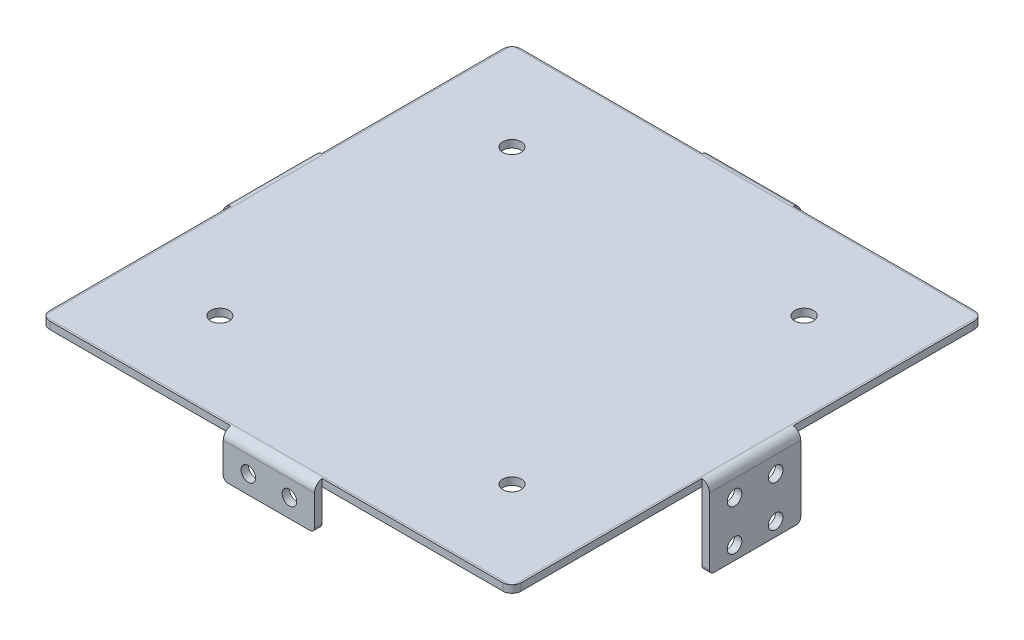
ISO-10303-21;
HEADER;
FILE_DESCRIPTION(('STEP AP214'),'2;1');
FILE_NAME('part.step','',(''),(''),'','','');
FILE_SCHEMA(('AUTOMOTIVE_DESIGN { 1 0 10303 214 1 1 1 1 }'));
ENDSEC;
DATA;
#1=APPLICATION_CONTEXT('core data for automotive mechanical design processes');
#2=APPLICATION_PROTOCOL_DEFINITION('international standard','automotive_design',2000,#1);
#3=PRODUCT_CONTEXT('',#1,'mechanical');
#4=PRODUCT('Part','Part','',(#3));
#5=PRODUCT_RELATED_PRODUCT_CATEGORY('part','',(#4));
#6=PRODUCT_DEFINITION_FORMATION('','',#4);
#7=PRODUCT_DEFINITION_CONTEXT('part definition',#1,'design');
#8=PRODUCT_DEFINITION('design','',#6,#7);
#9=PRODUCT_DEFINITION_SHAPE('','',#8);
#10=(LENGTH_UNIT() NAMED_UNIT(*) SI_UNIT(.MILLI.,.METRE.));
#11=(NAMED_UNIT(*) PLANE_ANGLE_UNIT() SI_UNIT($,.RADIAN.));
#12=(NAMED_UNIT(*) SI_UNIT($,.STERADIAN.) SOLID_ANGLE_UNIT());
#13=UNCERTAINTY_MEASURE_WITH_UNIT(LENGTH_MEASURE(1.E-05),#10,'distance_accuracy_value','');
#14=(GEOMETRIC_REPRESENTATION_CONTEXT(3) GLOBAL_UNCERTAINTY_ASSIGNED_CONTEXT((#13)) GLOBAL_UNIT_ASSIGNED_CONTEXT((#10,
#11,#12)) REPRESENTATION_CONTEXT('',''));
#15=CARTESIAN_POINT('',(0.,0.,0.));
#16=DIRECTION('',(0.,0.,1.));
#17=DIRECTION('',(1.,0.,0.));
#18=AXIS2_PLACEMENT_3D('',#15,#16,#17);
#19=CARTESIAN_POINT('',(51.63,1.63,51.63));
#20=DIRECTION('',(-1.,0.,0.));
#21=DIRECTION('',(0.,0.,1.));
#22=AXIS2_PLACEMENT_3D('',#19,#20,#21);
#23=PLANE('',#22);
#24=DIRECTION('',(0.,0.,-1.));
#25=VECTOR('',#24,1.);
#26=CARTESIAN_POINT('',(51.63,0.,51.63));
#27=LINE('',#26,#25);
#28=CARTESIAN_POINT('',(51.63,0.,-9.99999999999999));
#29=VERTEX_POINT('',#28);
#30=CARTESIAN_POINT('',(51.63,0.,-49.63));
#31=VERTEX_POINT('',#30);
#32=EDGE_CURVE('E326',#29,#31,#27,.T.);
#33=ORIENTED_EDGE('',*,*,#32,.T.);
#34=DIRECTION('',(0.,-1.,0.));
#35=VECTOR('',#34,1.);
#36=CARTESIAN_POINT('',(51.63,1.59547704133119,-49.63));
#37=LINE('',#36,#35);
#38=CARTESIAN_POINT('',(51.63,1.59547704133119,-49.63));
#39=VERTEX_POINT('',#38);
#40=EDGE_CURVE('E468',#31,#39,#37,.F.);
#41=ORIENTED_EDGE('',*,*,#40,.T.);
#42=DIRECTION('',(0.,0.,-1.));
#43=VECTOR('',#42,1.);
#44=CARTESIAN_POINT('',(51.63,1.59547704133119,-51.63));
#45=LINE('',#44,#43);
#46=CARTESIAN_POINT('',(51.63,1.59547704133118,-9.99999999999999));
#47=VERTEX_POINT('',#46);
#48=EDGE_CURVE('E332',#39,#47,#45,.F.);
#49=ORIENTED_EDGE('',*,*,#48,.T.);
#50=DIRECTION('',(0.,1.,0.));
#51=VECTOR('',#50,1.);
#52=CARTESIAN_POINT('',(51.63,-15.95,-9.99999999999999));
#53=LINE('',#52,#51);
#54=EDGE_CURVE('E305',#29,#47,#53,.T.);
#55=ORIENTED_EDGE('',*,*,#54,.F.);
#56=EDGE_LOOP('',(#33,#41,#49,#55));
#57=FACE_BOUND('',#56,.T.);
#58=ADVANCED_FACE('F38',(#57),#23,.F.);
#59=CARTESIAN_POINT('',(-51.63,1.63,51.63));
#60=DIRECTION('',(-1.,0.,0.));
#61=DIRECTION('',(0.,0.,1.));
#62=AXIS2_PLACEMENT_3D('',#59,#60,#61);
#63=PLANE('',#62);
#64=DIRECTION('',(0.,0.,1.));
#65=VECTOR('',#64,1.);
#66=CARTESIAN_POINT('',(-51.63,1.59547704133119,-9.99999999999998));
#67=LINE('',#66,#65);
#68=CARTESIAN_POINT('',(-51.63,1.59547704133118,-9.99999999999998));
#69=VERTEX_POINT('',#68);
#70=CARTESIAN_POINT('',(-51.63,1.59547704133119,-49.63));
#71=VERTEX_POINT('',#70);
#72=EDGE_CURVE('E456',#69,#71,#67,.F.);
#73=ORIENTED_EDGE('',*,*,#72,.T.);
#74=DIRECTION('',(0.,-1.,0.));
#75=VECTOR('',#74,1.);
#76=CARTESIAN_POINT('',(-51.63,1.63,-49.63));
#77=LINE('',#76,#75);
#78=CARTESIAN_POINT('',(-51.63,0.,-49.63));
#79=VERTEX_POINT('',#78);
#80=EDGE_CURVE('E48',#71,#79,#77,.T.);
#81=ORIENTED_EDGE('',*,*,#80,.T.);
#82=DIRECTION('',(0.,0.,-1.));
#83=VECTOR('',#82,1.);
#84=CARTESIAN_POINT('',(-51.63,0.,51.63));
#85=LINE('',#84,#83);
#86=CARTESIAN_POINT('',(-51.63,0.,-9.99999999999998));
#87=VERTEX_POINT('',#86);
#88=EDGE_CURVE('E356',#87,#79,#85,.T.);
#89=ORIENTED_EDGE('',*,*,#88,.F.);
#90=DIRECTION('',(0.,1.,0.));
#91=VECTOR('',#90,1.);
#92=CARTESIAN_POINT('',(-51.63,-15.95,-9.99999999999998));
#93=LINE('',#92,#91);
#94=EDGE_CURVE('E664',#87,#69,#93,.T.);
#95=ORIENTED_EDGE('',*,*,#94,.T.);
#96=EDGE_LOOP('',(#73,#81,#89,#95));
#97=FACE_BOUND('',#96,.T.);
#98=ADVANCED_FACE('F747',(#97),#63,.T.);
#99=CARTESIAN_POINT('',(-51.63,1.63,51.63));
#100=DIRECTION('',(0.,0.,-1.));
#101=DIRECTION('',(-1.,0.,0.));
#102=AXIS2_PLACEMENT_3D('',#99,#100,#101);
#103=PLANE('',#102);
#104=DIRECTION('',(1.,0.,0.));
#105=VECTOR('',#104,1.);
#106=CARTESIAN_POINT('',(-51.63,0.,51.63));
#107=LINE('',#106,#105);
#108=CARTESIAN_POINT('',(9.99999999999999,0.,51.63));
#109=VERTEX_POINT('',#108);
#110=CARTESIAN_POINT('',(49.63,0.,51.63));
#111=VERTEX_POINT('',#110);
#112=EDGE_CURVE('E343',#109,#111,#107,.T.);
#113=ORIENTED_EDGE('',*,*,#112,.T.);
#114=DIRECTION('',(0.,-1.,0.));
#115=VECTOR('',#114,1.);
#116=CARTESIAN_POINT('',(49.63,1.63,51.63));
#117=LINE('',#116,#115);
#118=CARTESIAN_POINT('',(49.63,1.59547704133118,51.63));
#119=VERTEX_POINT('',#118);
#120=EDGE_CURVE('E717',#111,#119,#117,.F.);
#121=ORIENTED_EDGE('',*,*,#120,.T.);
#122=DIRECTION('',(1.,0.,0.));
#123=VECTOR('',#122,1.);
#124=CARTESIAN_POINT('',(51.63,1.59547704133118,51.63));
#125=LINE('',#124,#123);
#126=CARTESIAN_POINT('',(9.99999999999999,1.59547704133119,51.63));
#127=VERTEX_POINT('',#126);
#128=EDGE_CURVE('E437',#119,#127,#125,.F.);
#129=ORIENTED_EDGE('',*,*,#128,.T.);
#130=DIRECTION('',(0.,1.,0.));
#131=VECTOR('',#130,1.);
#132=CARTESIAN_POINT('',(9.99999999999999,-8.,51.63));
#133=LINE('',#132,#131);
#134=EDGE_CURVE('E675',#109,#127,#133,.T.);
#135=ORIENTED_EDGE('',*,*,#134,.F.);
#136=EDGE_LOOP('',(#113,#121,#129,#135));
#137=FACE_BOUND('',#136,.T.);
#138=ADVANCED_FACE('F744',(#137),#103,.F.);
#139=CARTESIAN_POINT('',(-51.63,1.63,-51.63));
#140=DIRECTION('',(0.,0.,-1.));
#141=DIRECTION('',(-1.,0.,0.));
#142=AXIS2_PLACEMENT_3D('',#139,#140,#141);
#143=PLANE('',#142);
#144=DIRECTION('',(-1.,0.,0.));
#145=VECTOR('',#144,1.);
#146=CARTESIAN_POINT('',(9.99999999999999,1.59547704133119,-51.63));
#147=LINE('',#146,#145);
#148=CARTESIAN_POINT('',(9.99999999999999,1.59547704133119,-51.63));
#149=VERTEX_POINT('',#148);
#150=CARTESIAN_POINT('',(49.63,1.59547704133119,-51.63));
#151=VERTEX_POINT('',#150);
#152=EDGE_CURVE('E435',#149,#151,#147,.F.);
#153=ORIENTED_EDGE('',*,*,#152,.T.);
#154=DIRECTION('',(0.,-1.,0.));
#155=VECTOR('',#154,1.);
#156=CARTESIAN_POINT('',(49.63,0.,-51.63));
#157=LINE('',#156,#155);
#158=CARTESIAN_POINT('',(49.63,0.,-51.63));
#159=VERTEX_POINT('',#158);
#160=EDGE_CURVE('E458',#151,#159,#157,.T.);
#161=ORIENTED_EDGE('',*,*,#160,.T.);
#162=DIRECTION('',(1.,0.,0.));
#163=VECTOR('',#162,1.);
#164=CARTESIAN_POINT('',(-51.63,0.,-51.63));
#165=LINE('',#164,#163);
#166=CARTESIAN_POINT('',(9.99999999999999,0.,-51.63));
#167=VERTEX_POINT('',#166);
#168=EDGE_CURVE('E341',#167,#159,#165,.T.);
#169=ORIENTED_EDGE('',*,*,#168,.F.);
#170=DIRECTION('',(0.,1.,0.));
#171=VECTOR('',#170,1.);
#172=CARTESIAN_POINT('',(9.99999999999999,-8.,-51.63));
#173=LINE('',#172,#171);
#174=EDGE_CURVE('E368',#167,#149,#173,.T.);
#175=ORIENTED_EDGE('',*,*,#174,.T.);
#176=EDGE_LOOP('',(#153,#161,#169,#175));
#177=FACE_BOUND('',#176,.T.);
#178=ADVANCED_FACE('F746',(#177),#143,.T.);
#179=CARTESIAN_POINT('',(-49.63,0.,-51.63));
#180=VERTEX_POINT('',#179);
#181=CARTESIAN_POINT('',(-10.,0.,-51.63));
#182=VERTEX_POINT('',#181);
#183=EDGE_CURVE('E338',#180,#182,#165,.T.);
#184=ORIENTED_EDGE('',*,*,#183,.F.);
#185=DIRECTION('',(0.,-1.,0.));
#186=VECTOR('',#185,1.);
#187=CARTESIAN_POINT('',(-49.63,1.63,-51.63));
#188=LINE('',#187,#186);
#189=CARTESIAN_POINT('',(-49.63,1.59547704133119,-51.63));
#190=VERTEX_POINT('',#189);
#191=EDGE_CURVE('E11',#180,#190,#188,.F.);
#192=ORIENTED_EDGE('',*,*,#191,.T.);
#193=DIRECTION('',(-1.,0.,0.));
#194=VECTOR('',#193,1.);
#195=CARTESIAN_POINT('',(-51.63,1.59547704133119,-51.63));
#196=LINE('',#195,#194);
#197=CARTESIAN_POINT('',(-10.,1.59547704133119,-51.63));
#198=VERTEX_POINT('',#197);
#199=EDGE_CURVE('E417',#190,#198,#196,.F.);
#200=ORIENTED_EDGE('',*,*,#199,.T.);
#201=DIRECTION('',(0.,1.,0.));
#202=VECTOR('',#201,1.);
#203=CARTESIAN_POINT('',(-10.,-8.,-51.63));
#204=LINE('',#203,#202);
#205=EDGE_CURVE('E371',#182,#198,#204,.T.);
#206=ORIENTED_EDGE('',*,*,#205,.F.);
#207=EDGE_LOOP('',(#184,#192,#200,#206));
#208=FACE_BOUND('',#207,.T.);
#209=ADVANCED_FACE('F414',(#208),#143,.T.);
#210=CARTESIAN_POINT('',(-51.63,0.,49.63));
#211=VERTEX_POINT('',#210);
#212=CARTESIAN_POINT('',(-51.63,0.,10.));
#213=VERTEX_POINT('',#212);
#214=EDGE_CURVE('E364',#211,#213,#85,.T.);
#215=ORIENTED_EDGE('',*,*,#214,.F.);
#216=DIRECTION('',(0.,-1.,0.));
#217=VECTOR('',#216,1.);
#218=CARTESIAN_POINT('',(-51.63,1.59547704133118,49.63));
#219=LINE('',#218,#217);
#220=CARTESIAN_POINT('',(-51.63,1.59547704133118,49.63));
#221=VERTEX_POINT('',#220);
#222=EDGE_CURVE('E64',#211,#221,#219,.F.);
#223=ORIENTED_EDGE('',*,*,#222,.T.);
#224=DIRECTION('',(0.,0.,1.));
#225=VECTOR('',#224,1.);
#226=CARTESIAN_POINT('',(-51.63,1.59547704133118,51.63));
#227=LINE('',#226,#225);
#228=CARTESIAN_POINT('',(-51.63,1.59547704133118,10.));
#229=VERTEX_POINT('',#228);
#230=EDGE_CURVE('E448',#221,#229,#227,.F.);
#231=ORIENTED_EDGE('',*,*,#230,.T.);
#232=DIRECTION('',(0.,1.,0.));
#233=VECTOR('',#232,1.);
#234=CARTESIAN_POINT('',(-51.63,-15.95,10.));
#235=LINE('',#234,#233);
#236=EDGE_CURVE('E657',#213,#229,#235,.T.);
#237=ORIENTED_EDGE('',*,*,#236,.F.);
#238=EDGE_LOOP('',(#215,#223,#231,#237));
#239=FACE_BOUND('',#238,.T.);
#240=ADVANCED_FACE('F701',(#239),#63,.T.);
#241=DIRECTION('',(1.,0.,0.));
#242=VECTOR('',#241,1.);
#243=CARTESIAN_POINT('',(-10.,1.59547704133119,51.63));
#244=LINE('',#243,#242);
#245=CARTESIAN_POINT('',(-10.,1.59547704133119,51.63));
#246=VERTEX_POINT('',#245);
#247=CARTESIAN_POINT('',(-49.63,1.59547704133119,51.63));
#248=VERTEX_POINT('',#247);
#249=EDGE_CURVE('E445',#246,#248,#244,.F.);
#250=ORIENTED_EDGE('',*,*,#249,.T.);
#251=DIRECTION('',(0.,-1.,0.));
#252=VECTOR('',#251,1.);
#253=CARTESIAN_POINT('',(-49.63,0.,51.63));
#254=LINE('',#253,#252);
#255=CARTESIAN_POINT('',(-49.63,0.,51.63));
#256=VERTEX_POINT('',#255);
#257=EDGE_CURVE('E508',#248,#256,#254,.T.);
#258=ORIENTED_EDGE('',*,*,#257,.T.);
#259=CARTESIAN_POINT('',(-10.,0.,51.63));
#260=VERTEX_POINT('',#259);
#261=EDGE_CURVE('E349',#256,#260,#107,.T.);
#262=ORIENTED_EDGE('',*,*,#261,.T.);
#263=DIRECTION('',(0.,1.,0.));
#264=VECTOR('',#263,1.);
#265=CARTESIAN_POINT('',(-10.,-8.,51.63));
#266=LINE('',#265,#264);
#267=EDGE_CURVE('E380',#260,#246,#266,.T.);
#268=ORIENTED_EDGE('',*,*,#267,.T.);
#269=EDGE_LOOP('',(#250,#258,#262,#268));
#270=FACE_BOUND('',#269,.T.);
#271=ADVANCED_FACE('F695',(#270),#103,.F.);
#272=DIRECTION('',(0.,0.,-1.));
#273=VECTOR('',#272,1.);
#274=CARTESIAN_POINT('',(51.63,1.59547704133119,10.));
#275=LINE('',#274,#273);
#276=CARTESIAN_POINT('',(51.63,1.59547704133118,10.));
#277=VERTEX_POINT('',#276);
#278=CARTESIAN_POINT('',(51.63,1.59547704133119,49.63));
#279=VERTEX_POINT('',#278);
#280=EDGE_CURVE('E430',#277,#279,#275,.F.);
#281=ORIENTED_EDGE('',*,*,#280,.T.);
#282=DIRECTION('',(0.,-1.,0.));
#283=VECTOR('',#282,1.);
#284=CARTESIAN_POINT('',(51.63,1.63,49.63));
#285=LINE('',#284,#283);
#286=CARTESIAN_POINT('',(51.63,0.,49.63));
#287=VERTEX_POINT('',#286);
#288=EDGE_CURVE('E743',#279,#287,#285,.T.);
#289=ORIENTED_EDGE('',*,*,#288,.T.);
#290=CARTESIAN_POINT('',(51.63,0.,10.));
#291=VERTEX_POINT('',#290);
#292=EDGE_CURVE('E325',#287,#291,#27,.T.);
#293=ORIENTED_EDGE('',*,*,#292,.T.);
#294=DIRECTION('',(0.,1.,0.));
#295=VECTOR('',#294,1.);
#296=CARTESIAN_POINT('',(51.63,-15.95,10.));
#297=LINE('',#296,#295);
#298=EDGE_CURVE('E334',#291,#277,#297,.T.);
#299=ORIENTED_EDGE('',*,*,#298,.T.);
#300=EDGE_LOOP('',(#281,#289,#293,#299));
#301=FACE_BOUND('',#300,.T.);
#302=ADVANCED_FACE('F757',(#301),#23,.F.);
#303=CARTESIAN_POINT('',(0.,1.63,0.));
#304=DIRECTION('',(0.,1.,0.));
#305=DIRECTION('',(0.,0.,1.));
#306=AXIS2_PLACEMENT_3D('',#303,#304,#305);
#307=PLANE('',#306);
#308=CARTESIAN_POINT('',(32.0000000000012,1.63,-32.));
#309=DIRECTION('',(0.,1.,0.));
#310=DIRECTION('',(0.,0.,1.));
#311=AXIS2_PLACEMENT_3D('',#308,#309,#310);
#312=CIRCLE('',#311,2.025);
#313=CARTESIAN_POINT('',(32.0000000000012,1.63,-29.975));
#314=VERTEX_POINT('',#313);
#315=EDGE_CURVE('E561',#314,#314,#312,.T.);
#316=ORIENTED_EDGE('',*,*,#315,.F.);
#317=EDGE_LOOP('',(#316));
#318=FACE_BOUND('',#317,.T.);
#319=CARTESIAN_POINT('',(-31.9999999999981,1.63,32.));
#320=DIRECTION('',(0.,1.,0.));
#321=DIRECTION('',(0.,0.,1.));
#322=AXIS2_PLACEMENT_3D('',#319,#320,#321);
#323=CIRCLE('',#322,2.025);
#324=CARTESIAN_POINT('',(-31.9999999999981,1.63,34.025));
#325=VERTEX_POINT('',#324);
#326=EDGE_CURVE('E550',#325,#325,#323,.T.);
#327=ORIENTED_EDGE('',*,*,#326,.F.);
#328=EDGE_LOOP('',(#327));
#329=FACE_BOUND('',#328,.T.);
#330=CARTESIAN_POINT('',(-31.9999999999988,1.63,-32.));
#331=DIRECTION('',(0.,1.,0.));
#332=DIRECTION('',(0.,0.,1.));
#333=AXIS2_PLACEMENT_3D('',#330,#331,#332);
#334=CIRCLE('',#333,2.025);
#335=CARTESIAN_POINT('',(-31.9999999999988,1.63,-29.975));
#336=VERTEX_POINT('',#335);
#337=EDGE_CURVE('E547',#336,#336,#334,.T.);
#338=ORIENTED_EDGE('',*,*,#337,.F.);
#339=EDGE_LOOP('',(#338));
#340=FACE_BOUND('',#339,.T.);
#341=CARTESIAN_POINT('',(32.0000000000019,1.63,32.));
#342=DIRECTION('',(0.,1.,0.));
#343=DIRECTION('',(0.,0.,1.));
#344=AXIS2_PLACEMENT_3D('',#341,#342,#343);
#345=CIRCLE('',#344,2.025);
#346=CARTESIAN_POINT('',(32.0000000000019,1.63,34.025));
#347=VERTEX_POINT('',#346);
#348=EDGE_CURVE('E544',#347,#347,#345,.T.);
#349=ORIENTED_EDGE('',*,*,#348,.F.);
#350=EDGE_LOOP('',(#349));
#351=FACE_BOUND('',#350,.T.);
#352=DIRECTION('',(0.,0.,-1.));
#353=VECTOR('',#352,1.);
#354=CARTESIAN_POINT('',(51.26,1.63,0.));
#355=LINE('',#354,#353);
#356=CARTESIAN_POINT('',(51.26,1.63,50.7889219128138));
#357=VERTEX_POINT('',#356);
#358=CARTESIAN_POINT('',(51.26,1.63,-50.7889219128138));
#359=VERTEX_POINT('',#358);
#360=EDGE_CURVE('E827',#357,#359,#355,.T.);
#361=ORIENTED_EDGE('',*,*,#360,.T.);
#362=CARTESIAN_POINT('',(49.63,1.63,-49.63));
#363=DIRECTION('',(0.,1.,0.));
#364=DIRECTION('',(0.,0.,1.));
#365=AXIS2_PLACEMENT_3D('',#362,#363,#364);
#366=CIRCLE('',#365,2.);
#367=CARTESIAN_POINT('',(50.7889219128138,1.63,-51.26));
#368=VERTEX_POINT('',#367);
#369=EDGE_CURVE('E724',#359,#368,#366,.T.);
#370=ORIENTED_EDGE('',*,*,#369,.T.);
#371=DIRECTION('',(-1.,0.,0.));
#372=VECTOR('',#371,1.);
#373=CARTESIAN_POINT('',(0.,1.63,-51.26));
#374=LINE('',#373,#372);
#375=CARTESIAN_POINT('',(-50.7889219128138,1.63,-51.26));
#376=VERTEX_POINT('',#375);
#377=EDGE_CURVE('E824',#368,#376,#374,.T.);
#378=ORIENTED_EDGE('',*,*,#377,.T.);
#379=CARTESIAN_POINT('',(-49.63,1.63,-49.63));
#380=DIRECTION('',(0.,1.,0.));
#381=DIRECTION('',(0.,0.,1.));
#382=AXIS2_PLACEMENT_3D('',#379,#380,#381);
#383=CIRCLE('',#382,2.);
#384=CARTESIAN_POINT('',(-51.26,1.63,-50.7889219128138));
#385=VERTEX_POINT('',#384);
#386=EDGE_CURVE('E729',#376,#385,#383,.T.);
#387=ORIENTED_EDGE('',*,*,#386,.T.);
#388=DIRECTION('',(0.,0.,1.));
#389=VECTOR('',#388,1.);
#390=CARTESIAN_POINT('',(-51.26,1.63,0.));
#391=LINE('',#390,#389);
#392=CARTESIAN_POINT('',(-51.26,1.63,50.7889219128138));
#393=VERTEX_POINT('',#392);
#394=EDGE_CURVE('E819',#385,#393,#391,.T.);
#395=ORIENTED_EDGE('',*,*,#394,.T.);
#396=CARTESIAN_POINT('',(-49.63,1.63,49.63));
#397=DIRECTION('',(0.,1.,0.));
#398=DIRECTION('',(0.,0.,1.));
#399=AXIS2_PLACEMENT_3D('',#396,#397,#398);
#400=CIRCLE('',#399,2.);
#401=CARTESIAN_POINT('',(-50.7889219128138,1.63,51.26));
#402=VERTEX_POINT('',#401);
#403=EDGE_CURVE('E725',#393,#402,#400,.T.);
#404=ORIENTED_EDGE('',*,*,#403,.T.);
#405=DIRECTION('',(1.,0.,0.));
#406=VECTOR('',#405,1.);
#407=CARTESIAN_POINT('',(0.,1.63,51.26));
#408=LINE('',#407,#406);
#409=CARTESIAN_POINT('',(50.7889219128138,1.63,51.26));
#410=VERTEX_POINT('',#409);
#411=EDGE_CURVE('E822',#402,#410,#408,.T.);
#412=ORIENTED_EDGE('',*,*,#411,.T.);
#413=CARTESIAN_POINT('',(49.63,1.63,49.63));
#414=DIRECTION('',(0.,1.,0.));
#415=DIRECTION('',(0.,0.,1.));
#416=AXIS2_PLACEMENT_3D('',#413,#414,#415);
#417=CIRCLE('',#416,2.);
#418=EDGE_CURVE('E719',#410,#357,#417,.T.);
#419=ORIENTED_EDGE('',*,*,#418,.T.);
#420=EDGE_LOOP('',(#361,#370,#378,#387,#395,#404,#412,#419));
#421=FACE_BOUND('',#420,.T.);
#422=ADVANCED_FACE('F762',(#318,#329,#340,#351,#421),#307,.T.);
#423=CARTESIAN_POINT('',(0.,0.,0.));
#424=DIRECTION('',(0.,1.,0.));
#425=DIRECTION('',(0.,0.,1.));
#426=AXIS2_PLACEMENT_3D('',#423,#424,#425);
#427=PLANE('',#426);
#428=CARTESIAN_POINT('',(32.0000000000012,0.,-32.));
#429=DIRECTION('',(0.,1.,0.));
#430=DIRECTION('',(0.,0.,1.));
#431=AXIS2_PLACEMENT_3D('',#428,#429,#430);
#432=CIRCLE('',#431,2.025);
#433=CARTESIAN_POINT('',(32.0000000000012,0.,-29.975));
#434=VERTEX_POINT('',#433);
#435=EDGE_CURVE('E43',#434,#434,#432,.T.);
#436=ORIENTED_EDGE('',*,*,#435,.T.);
#437=EDGE_LOOP('',(#436));
#438=FACE_BOUND('',#437,.T.);
#439=CARTESIAN_POINT('',(-31.9999999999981,0.,32.));
#440=DIRECTION('',(0.,1.,0.));
#441=DIRECTION('',(0.,0.,1.));
#442=AXIS2_PLACEMENT_3D('',#439,#440,#441);
#443=CIRCLE('',#442,2.025);
#444=CARTESIAN_POINT('',(-31.9999999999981,0.,34.025));
#445=VERTEX_POINT('',#444);
#446=EDGE_CURVE('E548',#445,#445,#443,.T.);
#447=ORIENTED_EDGE('',*,*,#446,.T.);
#448=EDGE_LOOP('',(#447));
#449=FACE_BOUND('',#448,.T.);
#450=CARTESIAN_POINT('',(-31.9999999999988,0.,-32.));
#451=DIRECTION('',(0.,1.,0.));
#452=DIRECTION('',(0.,0.,1.));
#453=AXIS2_PLACEMENT_3D('',#450,#451,#452);
#454=CIRCLE('',#453,2.025);
#455=CARTESIAN_POINT('',(-31.9999999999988,0.,-29.975));
#456=VERTEX_POINT('',#455);
#457=EDGE_CURVE('E545',#456,#456,#454,.T.);
#458=ORIENTED_EDGE('',*,*,#457,.T.);
#459=EDGE_LOOP('',(#458));
#460=FACE_BOUND('',#459,.T.);
#461=CARTESIAN_POINT('',(32.0000000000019,0.,32.));
#462=DIRECTION('',(0.,1.,0.));
#463=DIRECTION('',(0.,0.,1.));
#464=AXIS2_PLACEMENT_3D('',#461,#462,#463);
#465=CIRCLE('',#464,2.025);
#466=CARTESIAN_POINT('',(32.0000000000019,0.,34.025));
#467=VERTEX_POINT('',#466);
#468=EDGE_CURVE('E541',#467,#467,#465,.T.);
#469=ORIENTED_EDGE('',*,*,#468,.T.);
#470=EDGE_LOOP('',(#469));
#471=FACE_BOUND('',#470,.T.);
#472=ORIENTED_EDGE('',*,*,#168,.T.);
#473=CARTESIAN_POINT('',(49.63,0.,-49.63));
#474=DIRECTION('',(0.,1.,0.));
#475=DIRECTION('',(0.,0.,1.));
#476=AXIS2_PLACEMENT_3D('',#473,#474,#475);
#477=CIRCLE('',#476,2.);
#478=EDGE_CURVE('E337',#159,#31,#477,.F.);
#479=ORIENTED_EDGE('',*,*,#478,.T.);
#480=ORIENTED_EDGE('',*,*,#32,.F.);
#481=EDGE_CURVE('E316',#291,#29,#27,.T.);
#482=ORIENTED_EDGE('',*,*,#481,.F.);
#483=ORIENTED_EDGE('',*,*,#292,.F.);
#484=CARTESIAN_POINT('',(49.63,0.,49.63));
#485=DIRECTION('',(0.,1.,0.));
#486=DIRECTION('',(0.,0.,1.));
#487=AXIS2_PLACEMENT_3D('',#484,#485,#486);
#488=CIRCLE('',#487,2.);
#489=EDGE_CURVE('E465',#287,#111,#488,.F.);
#490=ORIENTED_EDGE('',*,*,#489,.T.);
#491=ORIENTED_EDGE('',*,*,#112,.F.);
#492=EDGE_CURVE('E348',#260,#109,#107,.T.);
#493=ORIENTED_EDGE('',*,*,#492,.F.);
#494=ORIENTED_EDGE('',*,*,#261,.F.);
#495=CARTESIAN_POINT('',(-49.63,0.,49.63));
#496=DIRECTION('',(0.,1.,0.));
#497=DIRECTION('',(0.,0.,1.));
#498=AXIS2_PLACEMENT_3D('',#495,#496,#497);
#499=CIRCLE('',#498,2.);
#500=EDGE_CURVE('E463',#256,#211,#499,.F.);
#501=ORIENTED_EDGE('',*,*,#500,.T.);
#502=ORIENTED_EDGE('',*,*,#214,.T.);
#503=EDGE_CURVE('E363',#213,#87,#85,.T.);
#504=ORIENTED_EDGE('',*,*,#503,.T.);
#505=ORIENTED_EDGE('',*,*,#88,.T.);
#506=CARTESIAN_POINT('',(-49.63,0.,-49.63));
#507=DIRECTION('',(0.,1.,0.));
#508=DIRECTION('',(0.,0.,1.));
#509=AXIS2_PLACEMENT_3D('',#506,#507,#508);
#510=CIRCLE('',#509,2.);
#511=EDGE_CURVE('E461',#79,#180,#510,.F.);
#512=ORIENTED_EDGE('',*,*,#511,.T.);
#513=ORIENTED_EDGE('',*,*,#183,.T.);
#514=EDGE_CURVE('E339',#182,#167,#165,.T.);
#515=ORIENTED_EDGE('',*,*,#514,.T.);
#516=EDGE_LOOP('',(#472,#479,#480,#482,#483,#490,#491,#493,#494,#501,#502,#504,#505,#512,#513,#515));
#517=FACE_BOUND('',#516,.T.);
#518=ADVANCED_FACE('F336',(#438,#449,#460,#471,#517),#427,.F.);
#519=CARTESIAN_POINT('',(-10.,-8.,-51.63));
#520=DIRECTION('',(0.,0.,1.));
#521=DIRECTION('',(1.,0.,0.));
#522=AXIS2_PLACEMENT_3D('',#519,#520,#521);
#523=PLANE('',#522);
#524=CARTESIAN_POINT('',(-4.5,-4.,-51.63));
#525=DIRECTION('',(0.,0.,1.));
#526=DIRECTION('',(1.,0.,0.));
#527=AXIS2_PLACEMENT_3D('',#524,#525,#526);
#528=CIRCLE('',#527,1.6);
#529=CARTESIAN_POINT('',(-2.9,-4.,-51.63));
#530=VERTEX_POINT('',#529);
#531=EDGE_CURVE('E633',#530,#530,#528,.T.);
#532=ORIENTED_EDGE('',*,*,#531,.F.);
#533=EDGE_LOOP('',(#532));
#534=FACE_BOUND('',#533,.T.);
#535=CARTESIAN_POINT('',(4.5,-4.,-51.63));
#536=DIRECTION('',(0.,0.,1.));
#537=DIRECTION('',(1.,0.,0.));
#538=AXIS2_PLACEMENT_3D('',#535,#536,#537);
#539=CIRCLE('',#538,1.6);
#540=CARTESIAN_POINT('',(6.1,-4.,-51.63));
#541=VERTEX_POINT('',#540);
#542=EDGE_CURVE('E627',#541,#541,#539,.T.);
#543=ORIENTED_EDGE('',*,*,#542,.F.);
#544=EDGE_LOOP('',(#543));
#545=FACE_BOUND('',#544,.T.);
#546=CARTESIAN_POINT('',(-10.,-7.,-51.63));
#547=VERTEX_POINT('',#546);
#548=EDGE_CURVE('E382',#547,#182,#204,.T.);
#549=ORIENTED_EDGE('',*,*,#548,.F.);
#550=CARTESIAN_POINT('',(-9.00000000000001,-7.,-51.63));
#551=DIRECTION('',(0.,0.,1.));
#552=DIRECTION('',(1.,0.,0.));
#553=AXIS2_PLACEMENT_3D('',#550,#551,#552);
#554=CIRCLE('',#553,1.);
#555=CARTESIAN_POINT('',(-9.00000000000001,-8.,-51.63));
#556=VERTEX_POINT('',#555);
#557=EDGE_CURVE('E925',#547,#556,#554,.T.);
#558=ORIENTED_EDGE('',*,*,#557,.T.);
#559=DIRECTION('',(1.,0.,0.));
#560=VECTOR('',#559,1.);
#561=CARTESIAN_POINT('',(-10.,-8.,-51.63));
#562=LINE('',#561,#560);
#563=CARTESIAN_POINT('',(8.99999999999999,-8.,-51.63));
#564=VERTEX_POINT('',#563);
#565=EDGE_CURVE('E396',#556,#564,#562,.T.);
#566=ORIENTED_EDGE('',*,*,#565,.T.);
#567=CARTESIAN_POINT('',(8.99999999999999,-7.,-51.63));
#568=DIRECTION('',(0.,0.,1.));
#569=DIRECTION('',(1.,0.,0.));
#570=AXIS2_PLACEMENT_3D('',#567,#568,#569);
#571=CIRCLE('',#570,1.);
#572=CARTESIAN_POINT('',(9.99999999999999,-7.,-51.63));
#573=VERTEX_POINT('',#572);
#574=EDGE_CURVE('E924',#564,#573,#571,.T.);
#575=ORIENTED_EDGE('',*,*,#574,.T.);
#576=EDGE_CURVE('E373',#573,#167,#173,.T.);
#577=ORIENTED_EDGE('',*,*,#576,.T.);
#578=ORIENTED_EDGE('',*,*,#514,.F.);
#579=EDGE_LOOP('',(#549,#558,#566,#575,#577,#578));
#580=FACE_BOUND('',#579,.T.);
#581=ADVANCED_FACE('F412',(#534,#545,#580),#523,.T.);
#582=CARTESIAN_POINT('',(-10.,-8.,-51.63));
#583=DIRECTION('',(-1.,0.,0.));
#584=DIRECTION('',(0.,0.,1.));
#585=AXIS2_PLACEMENT_3D('',#582,#583,#584);
#586=PLANE('',#585);
#587=ORIENTED_EDGE('',*,*,#205,.T.);
#588=CARTESIAN_POINT('',(-10.,-0.37,-51.26));
#589=DIRECTION('',(-1.,0.,0.));
#590=DIRECTION('',(0.,0.,1.));
#591=AXIS2_PLACEMENT_3D('',#588,#589,#590);
#592=CIRCLE('',#591,2.);
#593=CARTESIAN_POINT('',(-10.,-0.370000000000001,-53.26));
#594=VERTEX_POINT('',#593);
#595=EDGE_CURVE('E420',#198,#594,#592,.T.);
#596=ORIENTED_EDGE('',*,*,#595,.T.);
#597=DIRECTION('',(0.,1.,0.));
#598=VECTOR('',#597,1.);
#599=CARTESIAN_POINT('',(-10.,-8.,-53.26));
#600=LINE('',#599,#598);
#601=CARTESIAN_POINT('',(-10.,-7.,-53.26));
#602=VERTEX_POINT('',#601);
#603=EDGE_CURVE('E389',#602,#594,#600,.T.);
#604=ORIENTED_EDGE('',*,*,#603,.F.);
#605=DIRECTION('',(0.,0.,1.));
#606=VECTOR('',#605,1.);
#607=CARTESIAN_POINT('',(-10.,-7.,-51.63));
#608=LINE('',#607,#606);
#609=EDGE_CURVE('E333',#602,#547,#608,.T.);
#610=ORIENTED_EDGE('',*,*,#609,.T.);
#611=ORIENTED_EDGE('',*,*,#548,.T.);
#612=EDGE_LOOP('',(#587,#596,#604,#610,#611));
#613=FACE_BOUND('',#612,.T.);
#614=ADVANCED_FACE('F419',(#613),#586,.T.);
#615=CARTESIAN_POINT('',(-10.,-8.,-53.26));
#616=DIRECTION('',(0.,0.,-1.));
#617=DIRECTION('',(-1.,0.,0.));
#618=AXIS2_PLACEMENT_3D('',#615,#616,#617);
#619=PLANE('',#618);
#620=CARTESIAN_POINT('',(-4.5,-4.,-53.26));
#621=DIRECTION('',(0.,0.,1.));
#622=DIRECTION('',(1.,0.,0.));
#623=AXIS2_PLACEMENT_3D('',#620,#621,#622);
#624=CIRCLE('',#623,1.6);
#625=CARTESIAN_POINT('',(-2.9,-4.,-53.26));
#626=VERTEX_POINT('',#625);
#627=EDGE_CURVE('E613',#626,#626,#624,.T.);
#628=ORIENTED_EDGE('',*,*,#627,.T.);
#629=EDGE_LOOP('',(#628));
#630=FACE_BOUND('',#629,.T.);
#631=CARTESIAN_POINT('',(4.5,-4.,-53.26));
#632=DIRECTION('',(0.,0.,1.));
#633=DIRECTION('',(-1.,0.,0.));
#634=AXIS2_PLACEMENT_3D('',#631,#632,#633);
#635=CIRCLE('',#634,1.6);
#636=CARTESIAN_POINT('',(6.1,-4.,-53.26));
#637=VERTEX_POINT('',#636);
#638=EDGE_CURVE('E620',#637,#637,#635,.T.);
#639=ORIENTED_EDGE('',*,*,#638,.T.);
#640=EDGE_LOOP('',(#639));
#641=FACE_BOUND('',#640,.T.);
#642=ORIENTED_EDGE('',*,*,#603,.T.);
#643=DIRECTION('',(-1.,0.,0.));
#644=VECTOR('',#643,1.);
#645=CARTESIAN_POINT('',(-10.,-0.370000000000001,-53.26));
#646=LINE('',#645,#644);
#647=CARTESIAN_POINT('',(9.99999999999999,-0.370000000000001,-53.26));
#648=VERTEX_POINT('',#647);
#649=EDGE_CURVE('E426',#594,#648,#646,.F.);
#650=ORIENTED_EDGE('',*,*,#649,.T.);
#651=DIRECTION('',(0.,1.,0.));
#652=VECTOR('',#651,1.);
#653=CARTESIAN_POINT('',(9.99999999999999,-8.,-53.26));
#654=LINE('',#653,#652);
#655=CARTESIAN_POINT('',(9.99999999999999,-7.,-53.26));
#656=VERTEX_POINT('',#655);
#657=EDGE_CURVE('E384',#656,#648,#654,.T.);
#658=ORIENTED_EDGE('',*,*,#657,.F.);
#659=CARTESIAN_POINT('',(8.99999999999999,-7.,-53.26));
#660=DIRECTION('',(0.,0.,-1.));
#661=DIRECTION('',(-1.,0.,0.));
#662=AXIS2_PLACEMENT_3D('',#659,#660,#661);
#663=CIRCLE('',#662,1.);
#664=CARTESIAN_POINT('',(8.99999999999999,-8.,-53.26));
#665=VERTEX_POINT('',#664);
#666=EDGE_CURVE('E911',#656,#665,#663,.T.);
#667=ORIENTED_EDGE('',*,*,#666,.T.);
#668=DIRECTION('',(-1.,0.,0.));
#669=VECTOR('',#668,1.);
#670=CARTESIAN_POINT('',(-10.,-8.,-53.26));
#671=LINE('',#670,#669);
#672=CARTESIAN_POINT('',(-9.00000000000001,-8.,-53.26));
#673=VERTEX_POINT('',#672);
#674=EDGE_CURVE('E391',#665,#673,#671,.T.);
#675=ORIENTED_EDGE('',*,*,#674,.T.);
#676=CARTESIAN_POINT('',(-9.00000000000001,-7.,-53.26));
#677=DIRECTION('',(0.,0.,-1.));
#678=DIRECTION('',(-1.,0.,0.));
#679=AXIS2_PLACEMENT_3D('',#676,#677,#678);
#680=CIRCLE('',#679,1.);
#681=EDGE_CURVE('E914',#673,#602,#680,.T.);
#682=ORIENTED_EDGE('',*,*,#681,.T.);
#683=EDGE_LOOP('',(#642,#650,#658,#667,#675,#682));
#684=FACE_BOUND('',#683,.T.);
#685=ADVANCED_FACE('F910',(#630,#641,#684),#619,.T.);
#686=CARTESIAN_POINT('',(9.99999999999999,-8.,-51.63));
#687=DIRECTION('',(1.,0.,0.));
#688=DIRECTION('',(0.,0.,-1.));
#689=AXIS2_PLACEMENT_3D('',#686,#687,#688);
#690=PLANE('',#689);
#691=ORIENTED_EDGE('',*,*,#657,.T.);
#692=CARTESIAN_POINT('',(9.99999999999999,-0.37,-51.26));
#693=DIRECTION('',(1.,0.,0.));
#694=DIRECTION('',(0.,0.,-1.));
#695=AXIS2_PLACEMENT_3D('',#692,#693,#694);
#696=CIRCLE('',#695,2.);
#697=EDGE_CURVE('E428',#648,#149,#696,.T.);
#698=ORIENTED_EDGE('',*,*,#697,.T.);
#699=ORIENTED_EDGE('',*,*,#174,.F.);
#700=ORIENTED_EDGE('',*,*,#576,.F.);
#701=DIRECTION('',(0.,0.,-1.));
#702=VECTOR('',#701,1.);
#703=CARTESIAN_POINT('',(9.99999999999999,-7.,-51.63));
#704=LINE('',#703,#702);
#705=EDGE_CURVE('E909',#573,#656,#704,.T.);
#706=ORIENTED_EDGE('',*,*,#705,.T.);
#707=EDGE_LOOP('',(#691,#698,#699,#700,#706));
#708=FACE_BOUND('',#707,.T.);
#709=ADVANCED_FACE('F905',(#708),#690,.T.);
#710=CARTESIAN_POINT('',(0.,-8.,0.));
#711=DIRECTION('',(0.,-1.,0.));
#712=DIRECTION('',(0.,0.,-1.));
#713=AXIS2_PLACEMENT_3D('',#710,#711,#712);
#714=PLANE('',#713);
#715=ORIENTED_EDGE('',*,*,#565,.F.);
#716=DIRECTION('',(0.,0.,1.));
#717=VECTOR('',#716,1.);
#718=CARTESIAN_POINT('',(-9.00000000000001,-8.,0.));
#719=LINE('',#718,#717);
#720=EDGE_CURVE('E915',#556,#673,#719,.F.);
#721=ORIENTED_EDGE('',*,*,#720,.T.);
#722=ORIENTED_EDGE('',*,*,#674,.F.);
#723=DIRECTION('',(0.,0.,-1.));
#724=VECTOR('',#723,1.);
#725=CARTESIAN_POINT('',(8.99999999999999,-8.,0.));
#726=LINE('',#725,#724);
#727=EDGE_CURVE('E920',#665,#564,#726,.F.);
#728=ORIENTED_EDGE('',*,*,#727,.T.);
#729=EDGE_LOOP('',(#715,#721,#722,#728));
#730=FACE_BOUND('',#729,.T.);
#731=ADVANCED_FACE('F919',(#730),#714,.T.);
#732=CARTESIAN_POINT('',(-10.,-8.,51.63));
#733=DIRECTION('',(-1.,0.,0.));
#734=DIRECTION('',(0.,0.,1.));
#735=AXIS2_PLACEMENT_3D('',#732,#733,#734);
#736=PLANE('',#735);
#737=DIRECTION('',(0.,1.,0.));
#738=VECTOR('',#737,1.);
#739=CARTESIAN_POINT('',(-10.,-8.,53.26));
#740=LINE('',#739,#738);
#741=CARTESIAN_POINT('',(-10.,-7.,53.26));
#742=VERTEX_POINT('',#741);
#743=CARTESIAN_POINT('',(-10.,-0.370000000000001,53.26));
#744=VERTEX_POINT('',#743);
#745=EDGE_CURVE('E670',#742,#744,#740,.T.);
#746=ORIENTED_EDGE('',*,*,#745,.T.);
#747=CARTESIAN_POINT('',(-10.,-0.37,51.26));
#748=DIRECTION('',(-1.,0.,0.));
#749=DIRECTION('',(0.,0.,1.));
#750=AXIS2_PLACEMENT_3D('',#747,#748,#749);
#751=CIRCLE('',#750,2.);
#752=EDGE_CURVE('E443',#744,#246,#751,.T.);
#753=ORIENTED_EDGE('',*,*,#752,.T.);
#754=ORIENTED_EDGE('',*,*,#267,.F.);
#755=CARTESIAN_POINT('',(-10.,-7.,51.63));
#756=VERTEX_POINT('',#755);
#757=EDGE_CURVE('E402',#756,#260,#266,.T.);
#758=ORIENTED_EDGE('',*,*,#757,.F.);
#759=DIRECTION('',(0.,0.,1.));
#760=VECTOR('',#759,1.);
#761=CARTESIAN_POINT('',(-10.,-7.,53.26));
#762=LINE('',#761,#760);
#763=EDGE_CURVE('E686',#756,#742,#762,.T.);
#764=ORIENTED_EDGE('',*,*,#763,.T.);
#765=EDGE_LOOP('',(#746,#753,#754,#758,#764));
#766=FACE_BOUND('',#765,.T.);
#767=ADVANCED_FACE('F682',(#766),#736,.T.);
#768=CARTESIAN_POINT('',(-10.,-8.,51.63));
#769=DIRECTION('',(0.,0.,-1.));
#770=DIRECTION('',(-1.,0.,0.));
#771=AXIS2_PLACEMENT_3D('',#768,#769,#770);
#772=PLANE('',#771);
#773=CARTESIAN_POINT('',(-4.5,-4.,51.63));
#774=DIRECTION('',(0.,0.,-1.));
#775=DIRECTION('',(-1.,0.,0.));
#776=AXIS2_PLACEMENT_3D('',#773,#774,#775);
#777=CIRCLE('',#776,1.6);
#778=CARTESIAN_POINT('',(-2.9,-4.,51.63));
#779=VERTEX_POINT('',#778);
#780=EDGE_CURVE('E630',#779,#779,#777,.T.);
#781=ORIENTED_EDGE('',*,*,#780,.F.);
#782=EDGE_LOOP('',(#781));
#783=FACE_BOUND('',#782,.T.);
#784=CARTESIAN_POINT('',(4.5,-4.,51.63));
#785=DIRECTION('',(0.,0.,-1.));
#786=DIRECTION('',(-1.,0.,0.));
#787=AXIS2_PLACEMENT_3D('',#784,#785,#786);
#788=CIRCLE('',#787,1.6);
#789=CARTESIAN_POINT('',(6.1,-4.,51.63));
#790=VERTEX_POINT('',#789);
#791=EDGE_CURVE('E616',#790,#790,#788,.T.);
#792=ORIENTED_EDGE('',*,*,#791,.F.);
#793=EDGE_LOOP('',(#792));
#794=FACE_BOUND('',#793,.T.);
#795=CARTESIAN_POINT('',(9.99999999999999,-7.,51.63));
#796=VERTEX_POINT('',#795);
#797=EDGE_CURVE('E672',#796,#109,#133,.T.);
#798=ORIENTED_EDGE('',*,*,#797,.F.);
#799=CARTESIAN_POINT('',(8.99999999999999,-7.,51.63));
#800=DIRECTION('',(0.,0.,-1.));
#801=DIRECTION('',(-1.,0.,0.));
#802=AXIS2_PLACEMENT_3D('',#799,#800,#801);
#803=CIRCLE('',#802,1.);
#804=CARTESIAN_POINT('',(8.99999999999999,-8.,51.63));
#805=VERTEX_POINT('',#804);
#806=EDGE_CURVE('E936',#796,#805,#803,.T.);
#807=ORIENTED_EDGE('',*,*,#806,.T.);
#808=DIRECTION('',(-1.,0.,0.));
#809=VECTOR('',#808,1.);
#810=CARTESIAN_POINT('',(-10.,-8.,51.63));
#811=LINE('',#810,#809);
#812=CARTESIAN_POINT('',(-9.00000000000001,-8.,51.63));
#813=VERTEX_POINT('',#812);
#814=EDGE_CURVE('E667',#805,#813,#811,.T.);
#815=ORIENTED_EDGE('',*,*,#814,.T.);
#816=CARTESIAN_POINT('',(-9.00000000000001,-7.,51.63));
#817=DIRECTION('',(0.,0.,-1.));
#818=DIRECTION('',(-1.,0.,0.));
#819=AXIS2_PLACEMENT_3D('',#816,#817,#818);
#820=CIRCLE('',#819,1.);
#821=EDGE_CURVE('E775',#813,#756,#820,.T.);
#822=ORIENTED_EDGE('',*,*,#821,.T.);
#823=ORIENTED_EDGE('',*,*,#757,.T.);
#824=ORIENTED_EDGE('',*,*,#492,.T.);
#825=EDGE_LOOP('',(#798,#807,#815,#822,#823,#824));
#826=FACE_BOUND('',#825,.T.);
#827=ADVANCED_FACE('F773',(#783,#794,#826),#772,.T.);
#828=CARTESIAN_POINT('',(9.99999999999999,-8.,51.63));
#829=DIRECTION('',(1.,0.,0.));
#830=DIRECTION('',(0.,0.,-1.));
#831=AXIS2_PLACEMENT_3D('',#828,#829,#830);
#832=PLANE('',#831);
#833=ORIENTED_EDGE('',*,*,#134,.T.);
#834=CARTESIAN_POINT('',(9.99999999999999,-0.37,51.26));
#835=DIRECTION('',(1.,0.,0.));
#836=DIRECTION('',(0.,0.,-1.));
#837=AXIS2_PLACEMENT_3D('',#834,#835,#836);
#838=CIRCLE('',#837,2.);
#839=CARTESIAN_POINT('',(9.99999999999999,-0.370000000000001,53.26));
#840=VERTEX_POINT('',#839);
#841=EDGE_CURVE('E439',#127,#840,#838,.T.);
#842=ORIENTED_EDGE('',*,*,#841,.T.);
#843=DIRECTION('',(0.,1.,0.));
#844=VECTOR('',#843,1.);
#845=CARTESIAN_POINT('',(9.99999999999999,-8.,53.26));
#846=LINE('',#845,#844);
#847=CARTESIAN_POINT('',(9.99999999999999,-7.,53.26));
#848=VERTEX_POINT('',#847);
#849=EDGE_CURVE('E674',#848,#840,#846,.T.);
#850=ORIENTED_EDGE('',*,*,#849,.F.);
#851=DIRECTION('',(0.,0.,-1.));
#852=VECTOR('',#851,1.);
#853=CARTESIAN_POINT('',(9.99999999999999,-7.,51.63));
#854=LINE('',#853,#852);
#855=EDGE_CURVE('E933',#848,#796,#854,.T.);
#856=ORIENTED_EDGE('',*,*,#855,.T.);
#857=ORIENTED_EDGE('',*,*,#797,.T.);
#858=EDGE_LOOP('',(#833,#842,#850,#856,#857));
#859=FACE_BOUND('',#858,.T.);
#860=ADVANCED_FACE('F710',(#859),#832,.T.);
#861=CARTESIAN_POINT('',(-10.,-8.,53.26));
#862=DIRECTION('',(0.,0.,1.));
#863=DIRECTION('',(1.,0.,0.));
#864=AXIS2_PLACEMENT_3D('',#861,#862,#863);
#865=PLANE('',#864);
#866=CARTESIAN_POINT('',(-4.5,-4.,53.26));
#867=DIRECTION('',(0.,0.,1.));
#868=DIRECTION('',(1.,0.,0.));
#869=AXIS2_PLACEMENT_3D('',#866,#867,#868);
#870=CIRCLE('',#869,1.6);
#871=CARTESIAN_POINT('',(-2.9,-4.,53.26));
#872=VERTEX_POINT('',#871);
#873=EDGE_CURVE('E617',#872,#872,#870,.T.);
#874=ORIENTED_EDGE('',*,*,#873,.F.);
#875=EDGE_LOOP('',(#874));
#876=FACE_BOUND('',#875,.T.);
#877=CARTESIAN_POINT('',(4.5,-4.,53.26));
#878=DIRECTION('',(0.,0.,1.));
#879=DIRECTION('',(-1.,0.,0.));
#880=AXIS2_PLACEMENT_3D('',#877,#878,#879);
#881=CIRCLE('',#880,1.6);
#882=CARTESIAN_POINT('',(6.1,-4.,53.26));
#883=VERTEX_POINT('',#882);
#884=EDGE_CURVE('E612',#883,#883,#881,.T.);
#885=ORIENTED_EDGE('',*,*,#884,.F.);
#886=EDGE_LOOP('',(#885));
#887=FACE_BOUND('',#886,.T.);
#888=ORIENTED_EDGE('',*,*,#849,.T.);
#889=DIRECTION('',(1.,0.,0.));
#890=VECTOR('',#889,1.);
#891=CARTESIAN_POINT('',(-10.,-0.370000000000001,53.26));
#892=LINE('',#891,#890);
#893=EDGE_CURVE('E441',#840,#744,#892,.F.);
#894=ORIENTED_EDGE('',*,*,#893,.T.);
#895=ORIENTED_EDGE('',*,*,#745,.F.);
#896=CARTESIAN_POINT('',(-9.00000000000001,-7.,53.26));
#897=DIRECTION('',(0.,0.,1.));
#898=DIRECTION('',(1.,0.,0.));
#899=AXIS2_PLACEMENT_3D('',#896,#897,#898);
#900=CIRCLE('',#899,1.);
#901=CARTESIAN_POINT('',(-9.00000000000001,-8.,53.26));
#902=VERTEX_POINT('',#901);
#903=EDGE_CURVE('E779',#742,#902,#900,.T.);
#904=ORIENTED_EDGE('',*,*,#903,.T.);
#905=DIRECTION('',(1.,0.,0.));
#906=VECTOR('',#905,1.);
#907=CARTESIAN_POINT('',(-10.,-8.,53.26));
#908=LINE('',#907,#906);
#909=CARTESIAN_POINT('',(8.99999999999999,-8.,53.26));
#910=VERTEX_POINT('',#909);
#911=EDGE_CURVE('E655',#902,#910,#908,.T.);
#912=ORIENTED_EDGE('',*,*,#911,.T.);
#913=CARTESIAN_POINT('',(8.99999999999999,-7.,53.26));
#914=DIRECTION('',(0.,0.,1.));
#915=DIRECTION('',(1.,0.,0.));
#916=AXIS2_PLACEMENT_3D('',#913,#914,#915);
#917=CIRCLE('',#916,1.);
#918=EDGE_CURVE('E781',#910,#848,#917,.T.);
#919=ORIENTED_EDGE('',*,*,#918,.T.);
#920=EDGE_LOOP('',(#888,#894,#895,#904,#912,#919));
#921=FACE_BOUND('',#920,.T.);
#922=ADVANCED_FACE('F942',(#876,#887,#921),#865,.T.);
#923=CARTESIAN_POINT('',(0.,-8.,0.));
#924=DIRECTION('',(0.,1.,0.));
#925=DIRECTION('',(0.,0.,1.));
#926=AXIS2_PLACEMENT_3D('',#923,#924,#925);
#927=PLANE('',#926);
#928=ORIENTED_EDGE('',*,*,#814,.F.);
#929=DIRECTION('',(0.,0.,-1.));
#930=VECTOR('',#929,1.);
#931=CARTESIAN_POINT('',(8.99999999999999,-8.,53.26));
#932=LINE('',#931,#930);
#933=EDGE_CURVE('E940',#805,#910,#932,.F.);
#934=ORIENTED_EDGE('',*,*,#933,.T.);
#935=ORIENTED_EDGE('',*,*,#911,.F.);
#936=DIRECTION('',(0.,0.,1.));
#937=VECTOR('',#936,1.);
#938=CARTESIAN_POINT('',(-9.00000000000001,-8.,51.63));
#939=LINE('',#938,#937);
#940=EDGE_CURVE('E938',#902,#813,#939,.F.);
#941=ORIENTED_EDGE('',*,*,#940,.T.);
#942=EDGE_LOOP('',(#928,#934,#935,#941));
#943=FACE_BOUND('',#942,.T.);
#944=ADVANCED_FACE('F946',(#943),#927,.F.);
#945=CARTESIAN_POINT('',(-51.63,-15.95,10.));
#946=DIRECTION('',(1.,0.,0.));
#947=DIRECTION('',(0.,0.,-1.));
#948=AXIS2_PLACEMENT_3D('',#945,#946,#947);
#949=PLANE('',#948);
#950=CARTESIAN_POINT('',(-51.63,-13.,4.5));
#951=DIRECTION('',(1.,0.,0.));
#952=DIRECTION('',(0.,0.,-1.));
#953=AXIS2_PLACEMENT_3D('',#950,#951,#952);
#954=CIRCLE('',#953,1.6);
#955=CARTESIAN_POINT('',(-51.63,-13.,2.9));
#956=VERTEX_POINT('',#955);
#957=EDGE_CURVE('E609',#956,#956,#954,.T.);
#958=ORIENTED_EDGE('',*,*,#957,.F.);
#959=EDGE_LOOP('',(#958));
#960=FACE_BOUND('',#959,.T.);
#961=CARTESIAN_POINT('',(-51.63,-13.,-4.5));
#962=DIRECTION('',(1.,0.,0.));
#963=DIRECTION('',(0.,0.,-1.));
#964=AXIS2_PLACEMENT_3D('',#961,#962,#963);
#965=CIRCLE('',#964,1.6);
#966=CARTESIAN_POINT('',(-51.63,-13.,-6.1));
#967=VERTEX_POINT('',#966);
#968=EDGE_CURVE('E603',#967,#967,#965,.T.);
#969=ORIENTED_EDGE('',*,*,#968,.F.);
#970=EDGE_LOOP('',(#969));
#971=FACE_BOUND('',#970,.T.);
#972=CARTESIAN_POINT('',(-51.63,-4.,-4.5));
#973=DIRECTION('',(1.,0.,0.));
#974=DIRECTION('',(0.,0.,-1.));
#975=AXIS2_PLACEMENT_3D('',#972,#973,#974);
#976=CIRCLE('',#975,1.6);
#977=CARTESIAN_POINT('',(-51.63,-4.,-6.1));
#978=VERTEX_POINT('',#977);
#979=EDGE_CURVE('E597',#978,#978,#976,.T.);
#980=ORIENTED_EDGE('',*,*,#979,.F.);
#981=EDGE_LOOP('',(#980));
#982=FACE_BOUND('',#981,.T.);
#983=CARTESIAN_POINT('',(-51.63,-4.,4.5));
#984=DIRECTION('',(1.,0.,0.));
#985=DIRECTION('',(0.,0.,-1.));
#986=AXIS2_PLACEMENT_3D('',#983,#984,#985);
#987=CIRCLE('',#986,1.6);
#988=CARTESIAN_POINT('',(-51.63,-4.,2.9));
#989=VERTEX_POINT('',#988);
#990=EDGE_CURVE('E591',#989,#989,#987,.T.);
#991=ORIENTED_EDGE('',*,*,#990,.F.);
#992=EDGE_LOOP('',(#991));
#993=FACE_BOUND('',#992,.T.);
#994=DIRECTION('',(0.,0.,-1.));
#995=VECTOR('',#994,1.);
#996=CARTESIAN_POINT('',(-51.63,-15.95,10.));
#997=LINE('',#996,#995);
#998=CARTESIAN_POINT('',(-51.63,-15.95,9.00000000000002));
#999=VERTEX_POINT('',#998);
#1000=CARTESIAN_POINT('',(-51.63,-15.95,-8.99999999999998));
#1001=VERTEX_POINT('',#1000);
#1002=EDGE_CURVE('E311',#999,#1001,#997,.T.);
#1003=ORIENTED_EDGE('',*,*,#1002,.T.);
#1004=CARTESIAN_POINT('',(-51.63,-14.95,-8.99999999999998));
#1005=DIRECTION('',(1.,0.,0.));
#1006=DIRECTION('',(0.,0.,-1.));
#1007=AXIS2_PLACEMENT_3D('',#1004,#1005,#1006);
#1008=CIRCLE('',#1007,1.);
#1009=CARTESIAN_POINT('',(-51.63,-14.95,-9.99999999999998));
#1010=VERTEX_POINT('',#1009);
#1011=EDGE_CURVE('E814',#1001,#1010,#1008,.T.);
#1012=ORIENTED_EDGE('',*,*,#1011,.T.);
#1013=EDGE_CURVE('E652',#1010,#87,#93,.T.);
#1014=ORIENTED_EDGE('',*,*,#1013,.T.);
#1015=ORIENTED_EDGE('',*,*,#503,.F.);
#1016=CARTESIAN_POINT('',(-51.63,-14.95,10.));
#1017=VERTEX_POINT('',#1016);
#1018=EDGE_CURVE('E653',#1017,#213,#235,.T.);
#1019=ORIENTED_EDGE('',*,*,#1018,.F.);
#1020=CARTESIAN_POINT('',(-51.63,-14.95,9.00000000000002));
#1021=DIRECTION('',(1.,0.,0.));
#1022=DIRECTION('',(0.,0.,-1.));
#1023=AXIS2_PLACEMENT_3D('',#1020,#1021,#1022);
#1024=CIRCLE('',#1023,1.);
#1025=EDGE_CURVE('E812',#1017,#999,#1024,.T.);
#1026=ORIENTED_EDGE('',*,*,#1025,.T.);
#1027=EDGE_LOOP('',(#1003,#1012,#1014,#1015,#1019,#1026));
#1028=FACE_BOUND('',#1027,.T.);
#1029=ADVANCED_FACE('F894',(#960,#971,#982,#993,#1028),#949,.T.);
#1030=CARTESIAN_POINT('',(-51.63,-15.95,10.));
#1031=DIRECTION('',(0.,0.,1.));
#1032=DIRECTION('',(1.,0.,0.));
#1033=AXIS2_PLACEMENT_3D('',#1030,#1031,#1032);
#1034=PLANE('',#1033);
#1035=ORIENTED_EDGE('',*,*,#236,.T.);
#1036=CARTESIAN_POINT('',(-51.26,-0.37,10.));
#1037=DIRECTION('',(0.,0.,1.));
#1038=DIRECTION('',(1.,0.,0.));
#1039=AXIS2_PLACEMENT_3D('',#1036,#1037,#1038);
#1040=CIRCLE('',#1039,2.);
#1041=CARTESIAN_POINT('',(-53.26,-0.370000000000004,10.));
#1042=VERTEX_POINT('',#1041);
#1043=EDGE_CURVE('E450',#229,#1042,#1040,.T.);
#1044=ORIENTED_EDGE('',*,*,#1043,.T.);
#1045=DIRECTION('',(0.,1.,0.));
#1046=VECTOR('',#1045,1.);
#1047=CARTESIAN_POINT('',(-53.26,-15.95,10.));
#1048=LINE('',#1047,#1046);
#1049=CARTESIAN_POINT('',(-53.26,-14.95,10.));
#1050=VERTEX_POINT('',#1049);
#1051=EDGE_CURVE('E656',#1050,#1042,#1048,.T.);
#1052=ORIENTED_EDGE('',*,*,#1051,.F.);
#1053=DIRECTION('',(1.,0.,0.));
#1054=VECTOR('',#1053,1.);
#1055=CARTESIAN_POINT('',(-51.63,-14.95,10.));
#1056=LINE('',#1055,#1054);
#1057=EDGE_CURVE('E816',#1050,#1017,#1056,.T.);
#1058=ORIENTED_EDGE('',*,*,#1057,.T.);
#1059=ORIENTED_EDGE('',*,*,#1018,.T.);
#1060=EDGE_LOOP('',(#1035,#1044,#1052,#1058,#1059));
#1061=FACE_BOUND('',#1060,.T.);
#1062=ADVANCED_FACE('F880',(#1061),#1034,.T.);
#1063=CARTESIAN_POINT('',(-53.26,-15.95,10.));
#1064=DIRECTION('',(-1.,0.,0.));
#1065=DIRECTION('',(0.,0.,1.));
#1066=AXIS2_PLACEMENT_3D('',#1063,#1064,#1065);
#1067=PLANE('',#1066);
#1068=CARTESIAN_POINT('',(-53.26,-13.,4.5));
#1069=DIRECTION('',(1.,0.,0.));
#1070=DIRECTION('',(0.,0.,1.));
#1071=AXIS2_PLACEMENT_3D('',#1068,#1069,#1070);
#1072=CIRCLE('',#1071,1.6);
#1073=CARTESIAN_POINT('',(-53.26,-13.,6.1));
#1074=VERTEX_POINT('',#1073);
#1075=EDGE_CURVE('E578',#1074,#1074,#1072,.T.);
#1076=ORIENTED_EDGE('',*,*,#1075,.T.);
#1077=EDGE_LOOP('',(#1076));
#1078=FACE_BOUND('',#1077,.T.);
#1079=CARTESIAN_POINT('',(-53.26,-13.,-4.5));
#1080=DIRECTION('',(1.,0.,0.));
#1081=DIRECTION('',(0.,0.,-1.));
#1082=AXIS2_PLACEMENT_3D('',#1079,#1080,#1081);
#1083=CIRCLE('',#1082,1.6);
#1084=CARTESIAN_POINT('',(-53.26,-13.,-6.1));
#1085=VERTEX_POINT('',#1084);
#1086=EDGE_CURVE('E572',#1085,#1085,#1083,.T.);
#1087=ORIENTED_EDGE('',*,*,#1086,.T.);
#1088=EDGE_LOOP('',(#1087));
#1089=FACE_BOUND('',#1088,.T.);
#1090=CARTESIAN_POINT('',(-53.26,-4.,-4.5));
#1091=DIRECTION('',(1.,0.,0.));
#1092=DIRECTION('',(0.,0.,1.));
#1093=AXIS2_PLACEMENT_3D('',#1090,#1091,#1092);
#1094=CIRCLE('',#1093,1.6);
#1095=CARTESIAN_POINT('',(-53.26,-4.,-2.9));
#1096=VERTEX_POINT('',#1095);
#1097=EDGE_CURVE('E565',#1096,#1096,#1094,.T.);
#1098=ORIENTED_EDGE('',*,*,#1097,.T.);
#1099=EDGE_LOOP('',(#1098));
#1100=FACE_BOUND('',#1099,.T.);
#1101=CARTESIAN_POINT('',(-53.26,-4.,4.5));
#1102=DIRECTION('',(1.,0.,0.));
#1103=DIRECTION('',(0.,0.,-1.));
#1104=AXIS2_PLACEMENT_3D('',#1101,#1102,#1103);
#1105=CIRCLE('',#1104,1.6);
#1106=CARTESIAN_POINT('',(-53.26,-4.,2.9));
#1107=VERTEX_POINT('',#1106);
#1108=EDGE_CURVE('E583',#1107,#1107,#1105,.T.);
#1109=ORIENTED_EDGE('',*,*,#1108,.T.);
#1110=EDGE_LOOP('',(#1109));
#1111=FACE_BOUND('',#1110,.T.);
#1112=ORIENTED_EDGE('',*,*,#1051,.T.);
#1113=DIRECTION('',(0.,0.,1.));
#1114=VECTOR('',#1113,1.);
#1115=CARTESIAN_POINT('',(-53.26,-0.370000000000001,10.));
#1116=LINE('',#1115,#1114);
#1117=CARTESIAN_POINT('',(-53.26,-0.370000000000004,-9.99999999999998));
#1118=VERTEX_POINT('',#1117);
#1119=EDGE_CURVE('E452',#1042,#1118,#1116,.F.);
#1120=ORIENTED_EDGE('',*,*,#1119,.T.);
#1121=DIRECTION('',(0.,1.,0.));
#1122=VECTOR('',#1121,1.);
#1123=CARTESIAN_POINT('',(-53.26,-15.95,-9.99999999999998));
#1124=LINE('',#1123,#1122);
#1125=CARTESIAN_POINT('',(-53.26,-14.95,-9.99999999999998));
#1126=VERTEX_POINT('',#1125);
#1127=EDGE_CURVE('E660',#1126,#1118,#1124,.T.);
#1128=ORIENTED_EDGE('',*,*,#1127,.F.);
#1129=CARTESIAN_POINT('',(-53.26,-14.95,-8.99999999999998));
#1130=DIRECTION('',(-1.,0.,0.));
#1131=DIRECTION('',(0.,0.,1.));
#1132=AXIS2_PLACEMENT_3D('',#1129,#1130,#1131);
#1133=CIRCLE('',#1132,1.);
#1134=CARTESIAN_POINT('',(-53.26,-15.95,-8.99999999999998));
#1135=VERTEX_POINT('',#1134);
#1136=EDGE_CURVE('E806',#1126,#1135,#1133,.T.);
#1137=ORIENTED_EDGE('',*,*,#1136,.T.);
#1138=DIRECTION('',(0.,0.,1.));
#1139=VECTOR('',#1138,1.);
#1140=CARTESIAN_POINT('',(-53.26,-15.95,10.));
#1141=LINE('',#1140,#1139);
#1142=CARTESIAN_POINT('',(-53.26,-15.95,9.00000000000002));
#1143=VERTEX_POINT('',#1142);
#1144=EDGE_CURVE('E649',#1135,#1143,#1141,.T.);
#1145=ORIENTED_EDGE('',*,*,#1144,.T.);
#1146=CARTESIAN_POINT('',(-53.26,-14.95,9.00000000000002));
#1147=DIRECTION('',(-1.,0.,0.));
#1148=DIRECTION('',(0.,0.,1.));
#1149=AXIS2_PLACEMENT_3D('',#1146,#1147,#1148);
#1150=CIRCLE('',#1149,1.);
#1151=EDGE_CURVE('E804',#1143,#1050,#1150,.T.);
#1152=ORIENTED_EDGE('',*,*,#1151,.T.);
#1153=EDGE_LOOP('',(#1112,#1120,#1128,#1137,#1145,#1152));
#1154=FACE_BOUND('',#1153,.T.);
#1155=ADVANCED_FACE('F877',(#1078,#1089,#1100,#1111,#1154),#1067,.T.);
#1156=CARTESIAN_POINT('',(-51.63,-15.95,-9.99999999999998));
#1157=DIRECTION('',(0.,0.,-1.));
#1158=DIRECTION('',(-1.,0.,0.));
#1159=AXIS2_PLACEMENT_3D('',#1156,#1157,#1158);
#1160=PLANE('',#1159);
#1161=ORIENTED_EDGE('',*,*,#1127,.T.);
#1162=CARTESIAN_POINT('',(-51.26,-0.37,-9.99999999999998));
#1163=DIRECTION('',(0.,0.,-1.));
#1164=DIRECTION('',(-1.,0.,0.));
#1165=AXIS2_PLACEMENT_3D('',#1162,#1163,#1164);
#1166=CIRCLE('',#1165,2.);
#1167=EDGE_CURVE('E454',#1118,#69,#1166,.T.);
#1168=ORIENTED_EDGE('',*,*,#1167,.T.);
#1169=ORIENTED_EDGE('',*,*,#94,.F.);
#1170=ORIENTED_EDGE('',*,*,#1013,.F.);
#1171=DIRECTION('',(-1.,0.,0.));
#1172=VECTOR('',#1171,1.);
#1173=CARTESIAN_POINT('',(-53.26,-14.95,-9.99999999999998));
#1174=LINE('',#1173,#1172);
#1175=EDGE_CURVE('E801',#1010,#1126,#1174,.T.);
#1176=ORIENTED_EDGE('',*,*,#1175,.T.);
#1177=EDGE_LOOP('',(#1161,#1168,#1169,#1170,#1176));
#1178=FACE_BOUND('',#1177,.T.);
#1179=ADVANCED_FACE('F885',(#1178),#1160,.T.);
#1180=CARTESIAN_POINT('',(0.,-15.95,0.));
#1181=DIRECTION('',(0.,1.,0.));
#1182=DIRECTION('',(0.,0.,1.));
#1183=AXIS2_PLACEMENT_3D('',#1180,#1181,#1182);
#1184=PLANE('',#1183);
#1185=ORIENTED_EDGE('',*,*,#1144,.F.);
#1186=DIRECTION('',(-1.,0.,0.));
#1187=VECTOR('',#1186,1.);
#1188=CARTESIAN_POINT('',(-51.63,-15.95,-8.99999999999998));
#1189=LINE('',#1188,#1187);
#1190=EDGE_CURVE('E810',#1135,#1001,#1189,.F.);
#1191=ORIENTED_EDGE('',*,*,#1190,.T.);
#1192=ORIENTED_EDGE('',*,*,#1002,.F.);
#1193=DIRECTION('',(1.,0.,0.));
#1194=VECTOR('',#1193,1.);
#1195=CARTESIAN_POINT('',(-53.26,-15.95,9.00000000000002));
#1196=LINE('',#1195,#1194);
#1197=EDGE_CURVE('E808',#999,#1143,#1196,.F.);
#1198=ORIENTED_EDGE('',*,*,#1197,.T.);
#1199=EDGE_LOOP('',(#1185,#1191,#1192,#1198));
#1200=FACE_BOUND('',#1199,.T.);
#1201=ADVANCED_FACE('F891',(#1200),#1184,.F.);
#1202=CARTESIAN_POINT('',(51.63,-15.95,10.));
#1203=DIRECTION('',(-1.,0.,0.));
#1204=DIRECTION('',(0.,0.,1.));
#1205=AXIS2_PLACEMENT_3D('',#1202,#1203,#1204);
#1206=PLANE('',#1205);
#1207=CARTESIAN_POINT('',(51.63,-13.,4.5));
#1208=DIRECTION('',(-1.,0.,0.));
#1209=DIRECTION('',(0.,0.,1.));
#1210=AXIS2_PLACEMENT_3D('',#1207,#1208,#1209);
#1211=CIRCLE('',#1210,1.6);
#1212=CARTESIAN_POINT('',(51.63,-13.,6.1));
#1213=VERTEX_POINT('',#1212);
#1214=EDGE_CURVE('E606',#1213,#1213,#1211,.T.);
#1215=ORIENTED_EDGE('',*,*,#1214,.F.);
#1216=EDGE_LOOP('',(#1215));
#1217=FACE_BOUND('',#1216,.T.);
#1218=CARTESIAN_POINT('',(51.63,-13.,-4.5));
#1219=DIRECTION('',(-1.,0.,0.));
#1220=DIRECTION('',(0.,0.,1.));
#1221=AXIS2_PLACEMENT_3D('',#1218,#1219,#1220);
#1222=CIRCLE('',#1221,1.6);
#1223=CARTESIAN_POINT('',(51.63,-13.,-2.9));
#1224=VERTEX_POINT('',#1223);
#1225=EDGE_CURVE('E600',#1224,#1224,#1222,.T.);
#1226=ORIENTED_EDGE('',*,*,#1225,.F.);
#1227=EDGE_LOOP('',(#1226));
#1228=FACE_BOUND('',#1227,.T.);
#1229=CARTESIAN_POINT('',(51.63,-4.,-4.5));
#1230=DIRECTION('',(-1.,0.,0.));
#1231=DIRECTION('',(0.,0.,1.));
#1232=AXIS2_PLACEMENT_3D('',#1229,#1230,#1231);
#1233=CIRCLE('',#1232,1.6);
#1234=CARTESIAN_POINT('',(51.63,-4.,-2.9));
#1235=VERTEX_POINT('',#1234);
#1236=EDGE_CURVE('E594',#1235,#1235,#1233,.T.);
#1237=ORIENTED_EDGE('',*,*,#1236,.F.);
#1238=EDGE_LOOP('',(#1237));
#1239=FACE_BOUND('',#1238,.T.);
#1240=CARTESIAN_POINT('',(51.63,-4.,4.5));
#1241=DIRECTION('',(-1.,0.,0.));
#1242=DIRECTION('',(0.,0.,1.));
#1243=AXIS2_PLACEMENT_3D('',#1240,#1241,#1242);
#1244=CIRCLE('',#1243,1.6);
#1245=CARTESIAN_POINT('',(51.63,-4.,6.1));
#1246=VERTEX_POINT('',#1245);
#1247=EDGE_CURVE('E586',#1246,#1246,#1244,.T.);
#1248=ORIENTED_EDGE('',*,*,#1247,.F.);
#1249=EDGE_LOOP('',(#1248));
#1250=FACE_BOUND('',#1249,.T.);
#1251=DIRECTION('',(0.,0.,1.));
#1252=VECTOR('',#1251,1.);
#1253=CARTESIAN_POINT('',(51.63,-15.95,10.));
#1254=LINE('',#1253,#1252);
#1255=CARTESIAN_POINT('',(51.63,-15.95,-8.99999999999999));
#1256=VERTEX_POINT('',#1255);
#1257=CARTESIAN_POINT('',(51.63,-15.95,9.00000000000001));
#1258=VERTEX_POINT('',#1257);
#1259=EDGE_CURVE('E636',#1256,#1258,#1254,.T.);
#1260=ORIENTED_EDGE('',*,*,#1259,.T.);
#1261=CARTESIAN_POINT('',(51.63,-14.95,9.00000000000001));
#1262=DIRECTION('',(-1.,0.,0.));
#1263=DIRECTION('',(0.,0.,1.));
#1264=AXIS2_PLACEMENT_3D('',#1261,#1262,#1263);
#1265=CIRCLE('',#1264,1.);
#1266=CARTESIAN_POINT('',(51.63,-14.95,10.));
#1267=VERTEX_POINT('',#1266);
#1268=EDGE_CURVE('E798',#1258,#1267,#1265,.T.);
#1269=ORIENTED_EDGE('',*,*,#1268,.T.);
#1270=EDGE_CURVE('E320',#1267,#291,#297,.T.);
#1271=ORIENTED_EDGE('',*,*,#1270,.T.);
#1272=ORIENTED_EDGE('',*,*,#481,.T.);
#1273=CARTESIAN_POINT('',(51.63,-14.95,-9.99999999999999));
#1274=VERTEX_POINT('',#1273);
#1275=EDGE_CURVE('E301',#1274,#29,#53,.T.);
#1276=ORIENTED_EDGE('',*,*,#1275,.F.);
#1277=CARTESIAN_POINT('',(51.63,-14.95,-8.99999999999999));
#1278=DIRECTION('',(-1.,0.,0.));
#1279=DIRECTION('',(0.,0.,1.));
#1280=AXIS2_PLACEMENT_3D('',#1277,#1278,#1279);
#1281=CIRCLE('',#1280,1.);
#1282=EDGE_CURVE('E796',#1274,#1256,#1281,.T.);
#1283=ORIENTED_EDGE('',*,*,#1282,.T.);
#1284=EDGE_LOOP('',(#1260,#1269,#1271,#1272,#1276,#1283));
#1285=FACE_BOUND('',#1284,.T.);
#1286=ADVANCED_FACE('F318',(#1217,#1228,#1239,#1250,#1285),#1206,.T.);
#1287=CARTESIAN_POINT('',(51.63,-15.95,-9.99999999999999));
#1288=DIRECTION('',(0.,0.,-1.));
#1289=DIRECTION('',(-1.,0.,0.));
#1290=AXIS2_PLACEMENT_3D('',#1287,#1288,#1289);
#1291=PLANE('',#1290);
#1292=ORIENTED_EDGE('',*,*,#54,.T.);
#1293=CARTESIAN_POINT('',(51.26,-0.37,-9.99999999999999));
#1294=DIRECTION('',(0.,0.,-1.));
#1295=DIRECTION('',(-1.,0.,0.));
#1296=AXIS2_PLACEMENT_3D('',#1293,#1294,#1295);
#1297=CIRCLE('',#1296,2.);
#1298=CARTESIAN_POINT('',(53.26,-0.370000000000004,-9.99999999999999));
#1299=VERTEX_POINT('',#1298);
#1300=EDGE_CURVE('E830',#47,#1299,#1297,.T.);
#1301=ORIENTED_EDGE('',*,*,#1300,.T.);
#1302=DIRECTION('',(0.,1.,0.));
#1303=VECTOR('',#1302,1.);
#1304=CARTESIAN_POINT('',(53.26,-15.95,-9.99999999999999));
#1305=LINE('',#1304,#1303);
#1306=CARTESIAN_POINT('',(53.26,-14.95,-9.99999999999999));
#1307=VERTEX_POINT('',#1306);
#1308=EDGE_CURVE('E312',#1307,#1299,#1305,.T.);
#1309=ORIENTED_EDGE('',*,*,#1308,.F.);
#1310=DIRECTION('',(-1.,0.,0.));
#1311=VECTOR('',#1310,1.);
#1312=CARTESIAN_POINT('',(51.63,-14.95,-9.99999999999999));
#1313=LINE('',#1312,#1311);
#1314=EDGE_CURVE('E309',#1307,#1274,#1313,.T.);
#1315=ORIENTED_EDGE('',*,*,#1314,.T.);
#1316=ORIENTED_EDGE('',*,*,#1275,.T.);
#1317=EDGE_LOOP('',(#1292,#1301,#1309,#1315,#1316));
#1318=FACE_BOUND('',#1317,.T.);
#1319=ADVANCED_FACE('F303',(#1318),#1291,.T.);
#1320=CARTESIAN_POINT('',(53.26,-15.95,10.));
#1321=DIRECTION('',(1.,0.,0.));
#1322=DIRECTION('',(0.,0.,-1.));
#1323=AXIS2_PLACEMENT_3D('',#1320,#1321,#1322);
#1324=PLANE('',#1323);
#1325=CARTESIAN_POINT('',(53.26,-13.,4.5));
#1326=DIRECTION('',(1.,0.,0.));
#1327=DIRECTION('',(0.,0.,1.));
#1328=AXIS2_PLACEMENT_3D('',#1325,#1326,#1327);
#1329=CIRCLE('',#1328,1.6);
#1330=CARTESIAN_POINT('',(53.26,-13.,6.1));
#1331=VERTEX_POINT('',#1330);
#1332=EDGE_CURVE('E564',#1331,#1331,#1329,.T.);
#1333=ORIENTED_EDGE('',*,*,#1332,.F.);
#1334=EDGE_LOOP('',(#1333));
#1335=FACE_BOUND('',#1334,.T.);
#1336=CARTESIAN_POINT('',(53.26,-13.,-4.5));
#1337=DIRECTION('',(1.,0.,0.));
#1338=DIRECTION('',(0.,0.,-1.));
#1339=AXIS2_PLACEMENT_3D('',#1336,#1337,#1338);
#1340=CIRCLE('',#1339,1.6);
#1341=CARTESIAN_POINT('',(53.26,-13.,-6.1));
#1342=VERTEX_POINT('',#1341);
#1343=EDGE_CURVE('E575',#1342,#1342,#1340,.T.);
#1344=ORIENTED_EDGE('',*,*,#1343,.F.);
#1345=EDGE_LOOP('',(#1344));
#1346=FACE_BOUND('',#1345,.T.);
#1347=CARTESIAN_POINT('',(53.26,-4.,-4.5));
#1348=DIRECTION('',(1.,0.,0.));
#1349=DIRECTION('',(0.,0.,1.));
#1350=AXIS2_PLACEMENT_3D('',#1347,#1348,#1349);
#1351=CIRCLE('',#1350,1.6);
#1352=CARTESIAN_POINT('',(53.26,-4.,-2.9));
#1353=VERTEX_POINT('',#1352);
#1354=EDGE_CURVE('E569',#1353,#1353,#1351,.T.);
#1355=ORIENTED_EDGE('',*,*,#1354,.F.);
#1356=EDGE_LOOP('',(#1355));
#1357=FACE_BOUND('',#1356,.T.);
#1358=CARTESIAN_POINT('',(53.26,-4.,4.5));
#1359=DIRECTION('',(1.,0.,0.));
#1360=DIRECTION('',(0.,0.,-1.));
#1361=AXIS2_PLACEMENT_3D('',#1358,#1359,#1360);
#1362=CIRCLE('',#1361,1.6);
#1363=CARTESIAN_POINT('',(53.26,-4.,2.9));
#1364=VERTEX_POINT('',#1363);
#1365=EDGE_CURVE('E568',#1364,#1364,#1362,.T.);
#1366=ORIENTED_EDGE('',*,*,#1365,.F.);
#1367=EDGE_LOOP('',(#1366));
#1368=FACE_BOUND('',#1367,.T.);
#1369=ORIENTED_EDGE('',*,*,#1308,.T.);
#1370=DIRECTION('',(0.,0.,-1.));
#1371=VECTOR('',#1370,1.);
#1372=CARTESIAN_POINT('',(53.26,-0.370000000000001,10.));
#1373=LINE('',#1372,#1371);
#1374=CARTESIAN_POINT('',(53.26,-0.370000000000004,10.));
#1375=VERTEX_POINT('',#1374);
#1376=EDGE_CURVE('E832',#1299,#1375,#1373,.F.);
#1377=ORIENTED_EDGE('',*,*,#1376,.T.);
#1378=DIRECTION('',(0.,1.,0.));
#1379=VECTOR('',#1378,1.);
#1380=CARTESIAN_POINT('',(53.26,-15.95,10.));
#1381=LINE('',#1380,#1379);
#1382=CARTESIAN_POINT('',(53.26,-14.95,10.));
#1383=VERTEX_POINT('',#1382);
#1384=EDGE_CURVE('E643',#1383,#1375,#1381,.T.);
#1385=ORIENTED_EDGE('',*,*,#1384,.F.);
#1386=CARTESIAN_POINT('',(53.26,-14.95,9.00000000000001));
#1387=DIRECTION('',(1.,0.,0.));
#1388=DIRECTION('',(0.,0.,-1.));
#1389=AXIS2_PLACEMENT_3D('',#1386,#1387,#1388);
#1390=CIRCLE('',#1389,1.);
#1391=CARTESIAN_POINT('',(53.26,-15.95,9.00000000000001));
#1392=VERTEX_POINT('',#1391);
#1393=EDGE_CURVE('E790',#1383,#1392,#1390,.T.);
#1394=ORIENTED_EDGE('',*,*,#1393,.T.);
#1395=DIRECTION('',(0.,0.,-1.));
#1396=VECTOR('',#1395,1.);
#1397=CARTESIAN_POINT('',(53.26,-15.95,10.));
#1398=LINE('',#1397,#1396);
#1399=CARTESIAN_POINT('',(53.26,-15.95,-8.99999999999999));
#1400=VERTEX_POINT('',#1399);
#1401=EDGE_CURVE('E638',#1392,#1400,#1398,.T.);
#1402=ORIENTED_EDGE('',*,*,#1401,.T.);
#1403=CARTESIAN_POINT('',(53.26,-14.95,-8.99999999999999));
#1404=DIRECTION('',(1.,0.,0.));
#1405=DIRECTION('',(0.,0.,-1.));
#1406=AXIS2_PLACEMENT_3D('',#1403,#1404,#1405);
#1407=CIRCLE('',#1406,1.);
#1408=EDGE_CURVE('E784',#1400,#1307,#1407,.T.);
#1409=ORIENTED_EDGE('',*,*,#1408,.T.);
#1410=EDGE_LOOP('',(#1369,#1377,#1385,#1394,#1402,#1409));
#1411=FACE_BOUND('',#1410,.T.);
#1412=ADVANCED_FACE('F840',(#1335,#1346,#1357,#1368,#1411),#1324,.T.);
#1413=CARTESIAN_POINT('',(51.63,-15.95,10.));
#1414=DIRECTION('',(0.,0.,1.));
#1415=DIRECTION('',(1.,0.,0.));
#1416=AXIS2_PLACEMENT_3D('',#1413,#1414,#1415);
#1417=PLANE('',#1416);
#1418=ORIENTED_EDGE('',*,*,#1384,.T.);
#1419=CARTESIAN_POINT('',(51.26,-0.37,10.));
#1420=DIRECTION('',(0.,0.,1.));
#1421=DIRECTION('',(1.,0.,0.));
#1422=AXIS2_PLACEMENT_3D('',#1419,#1420,#1421);
#1423=CIRCLE('',#1422,2.);
#1424=EDGE_CURVE('E771',#1375,#277,#1423,.T.);
#1425=ORIENTED_EDGE('',*,*,#1424,.T.);
#1426=ORIENTED_EDGE('',*,*,#298,.F.);
#1427=ORIENTED_EDGE('',*,*,#1270,.F.);
#1428=DIRECTION('',(1.,0.,0.));
#1429=VECTOR('',#1428,1.);
#1430=CARTESIAN_POINT('',(51.63,-14.95,10.));
#1431=LINE('',#1430,#1429);
#1432=EDGE_CURVE('E780',#1267,#1383,#1431,.T.);
#1433=ORIENTED_EDGE('',*,*,#1432,.T.);
#1434=EDGE_LOOP('',(#1418,#1425,#1426,#1427,#1433));
#1435=FACE_BOUND('',#1434,.T.);
#1436=ADVANCED_FACE('F836',(#1435),#1417,.T.);
#1437=CARTESIAN_POINT('',(0.,-15.95,0.));
#1438=DIRECTION('',(0.,-1.,0.));
#1439=DIRECTION('',(0.,0.,-1.));
#1440=AXIS2_PLACEMENT_3D('',#1437,#1438,#1439);
#1441=PLANE('',#1440);
#1442=ORIENTED_EDGE('',*,*,#1401,.F.);
#1443=DIRECTION('',(1.,0.,0.));
#1444=VECTOR('',#1443,1.);
#1445=CARTESIAN_POINT('',(0.,-15.95,9.00000000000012));
#1446=LINE('',#1445,#1444);
#1447=EDGE_CURVE('E794',#1392,#1258,#1446,.F.);
#1448=ORIENTED_EDGE('',*,*,#1447,.T.);
#1449=ORIENTED_EDGE('',*,*,#1259,.F.);
#1450=DIRECTION('',(-1.,0.,0.));
#1451=VECTOR('',#1450,1.);
#1452=CARTESIAN_POINT('',(0.,-15.95,-8.99999999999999));
#1453=LINE('',#1452,#1451);
#1454=EDGE_CURVE('E792',#1256,#1400,#1453,.F.);
#1455=ORIENTED_EDGE('',*,*,#1454,.T.);
#1456=EDGE_LOOP('',(#1442,#1448,#1449,#1455));
#1457=FACE_BOUND('',#1456,.T.);
#1458=ADVANCED_FACE('F849',(#1457),#1441,.T.);
#1459=CARTESIAN_POINT('',(4.5,-4.,-53.26));
#1460=DIRECTION('',(0.,0.,1.));
#1461=DIRECTION('',(1.,0.,0.));
#1462=AXIS2_PLACEMENT_3D('',#1459,#1460,#1461);
#1463=CYLINDRICAL_SURFACE('',#1462,1.6);
#1464=CARTESIAN_POINT('',(6.1,-4.,51.63));
#1465=CARTESIAN_POINT('',(6.1,-4.,51.6469791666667));
#1466=CARTESIAN_POINT('',(6.1,-4.,51.6639583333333));
#1467=CARTESIAN_POINT('',(6.1,-4.,51.6979166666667));
#1468=CARTESIAN_POINT('',(6.1,-4.,51.7148958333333));
#1469=CARTESIAN_POINT('',(6.1,-4.,51.7488541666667));
#1470=CARTESIAN_POINT('',(6.1,-4.,51.7658333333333));
#1471=CARTESIAN_POINT('',(6.1,-4.,51.7997916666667));
#1472=CARTESIAN_POINT('',(6.1,-4.,51.8167708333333));
#1473=CARTESIAN_POINT('',(6.1,-4.,51.8507291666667));
#1474=CARTESIAN_POINT('',(6.1,-4.,51.8677083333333));
#1475=CARTESIAN_POINT('',(6.1,-4.,51.9016666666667));
#1476=CARTESIAN_POINT('',(6.1,-4.,51.9186458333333));
#1477=CARTESIAN_POINT('',(6.1,-4.,51.9526041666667));
#1478=CARTESIAN_POINT('',(6.1,-4.,51.9695833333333));
#1479=CARTESIAN_POINT('',(6.1,-4.,52.0035416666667));
#1480=CARTESIAN_POINT('',(6.1,-4.,52.0205208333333));
#1481=CARTESIAN_POINT('',(6.1,-4.,52.0544791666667));
#1482=CARTESIAN_POINT('',(6.1,-4.,52.0714583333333));
#1483=CARTESIAN_POINT('',(6.1,-4.,52.1054166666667));
#1484=CARTESIAN_POINT('',(6.1,-4.,52.1223958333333));
#1485=CARTESIAN_POINT('',(6.1,-4.,52.1563541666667));
#1486=CARTESIAN_POINT('',(6.1,-4.,52.1733333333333));
#1487=CARTESIAN_POINT('',(6.1,-4.,52.2072916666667));
#1488=CARTESIAN_POINT('',(6.1,-4.,52.2242708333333));
#1489=CARTESIAN_POINT('',(6.1,-4.,52.2582291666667));
#1490=CARTESIAN_POINT('',(6.1,-4.,52.2752083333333));
#1491=CARTESIAN_POINT('',(6.1,-4.,52.3091666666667));
#1492=CARTESIAN_POINT('',(6.1,-4.,52.3261458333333));
#1493=CARTESIAN_POINT('',(6.1,-4.,52.3601041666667));
#1494=CARTESIAN_POINT('',(6.1,-4.,52.3770833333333));
#1495=CARTESIAN_POINT('',(6.1,-4.,52.4110416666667));
#1496=CARTESIAN_POINT('',(6.1,-4.,52.4280208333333));
#1497=CARTESIAN_POINT('',(6.1,-4.,52.4619791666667));
#1498=CARTESIAN_POINT('',(6.1,-4.,52.4789583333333));
#1499=CARTESIAN_POINT('',(6.1,-4.,52.5129166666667));
#1500=CARTESIAN_POINT('',(6.1,-4.,52.5298958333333));
#1501=CARTESIAN_POINT('',(6.1,-4.,52.5638541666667));
#1502=CARTESIAN_POINT('',(6.1,-4.,52.5808333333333));
#1503=CARTESIAN_POINT('',(6.1,-4.,52.6147916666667));
#1504=CARTESIAN_POINT('',(6.1,-4.,52.6317708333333));
#1505=CARTESIAN_POINT('',(6.1,-4.,52.6657291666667));
#1506=CARTESIAN_POINT('',(6.1,-4.,52.6827083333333));
#1507=CARTESIAN_POINT('',(6.1,-4.,52.7166666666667));
#1508=CARTESIAN_POINT('',(6.1,-4.,52.7336458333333));
#1509=CARTESIAN_POINT('',(6.1,-4.,52.7676041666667));
#1510=CARTESIAN_POINT('',(6.1,-4.,52.7845833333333));
#1511=CARTESIAN_POINT('',(6.1,-4.,52.8185416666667));
#1512=CARTESIAN_POINT('',(6.1,-4.,52.8355208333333));
#1513=CARTESIAN_POINT('',(6.1,-4.,52.8694791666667));
#1514=CARTESIAN_POINT('',(6.1,-4.,52.8864583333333));
#1515=CARTESIAN_POINT('',(6.1,-4.,52.9204166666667));
#1516=CARTESIAN_POINT('',(6.1,-4.,52.9373958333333));
#1517=CARTESIAN_POINT('',(6.1,-4.,52.9713541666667));
#1518=CARTESIAN_POINT('',(6.1,-4.,52.9883333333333));
#1519=CARTESIAN_POINT('',(6.1,-4.,53.0222916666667));
#1520=CARTESIAN_POINT('',(6.1,-4.,53.0392708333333));
#1521=CARTESIAN_POINT('',(6.1,-4.,53.0732291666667));
#1522=CARTESIAN_POINT('',(6.1,-4.,53.0902083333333));
#1523=CARTESIAN_POINT('',(6.1,-4.,53.1241666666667));
#1524=CARTESIAN_POINT('',(6.1,-4.,53.1411458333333));
#1525=CARTESIAN_POINT('',(6.1,-4.,53.1751041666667));
#1526=CARTESIAN_POINT('',(6.1,-4.,53.1920833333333));
#1527=CARTESIAN_POINT('',(6.1,-4.,53.2260416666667));
#1528=CARTESIAN_POINT('',(6.1,-4.,53.2430208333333));
#1529=CARTESIAN_POINT('',(6.1,-4.,53.26));
#1530=B_SPLINE_CURVE_WITH_KNOTS('',3,(#1464,#1465,#1466,#1467,#1468,#1469,#1470,#1471,#1472,
#1473,#1474,#1475,#1476,#1477,#1478,#1479,#1480,#1481,#1482,#1483,#1484,#1485,#1486,#1487,#1488,
#1489,#1490,#1491,#1492,#1493,#1494,#1495,#1496,#1497,#1498,#1499,#1500,#1501,#1502,#1503,#1504,
#1505,#1506,#1507,#1508,#1509,#1510,#1511,#1512,#1513,#1514,#1515,#1516,#1517,#1518,#1519,#1520,
#1521,#1522,#1523,#1524,#1525,#1526,#1527,#1528,#1529),.UNSPECIFIED.,.F.,.F.,(4,2,2,2,2,2,2,2,2,
2,2,2,2,2,2,2,2,2,2,2,2,2,2,2,2,2,2,2,2,2,2,2,4),(0.,0.0509375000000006,0.101875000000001,
0.152812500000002,0.203750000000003,0.254687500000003,0.305625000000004,0.356562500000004,
0.407500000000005,0.458437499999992,0.509374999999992,0.560312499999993,0.611249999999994,
0.662187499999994,0.713124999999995,0.764062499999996,0.814999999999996,0.865937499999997,
0.916874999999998,0.967812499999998,1.01875,1.0696875,1.120625,1.1715625,1.22249999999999,
1.27343749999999,1.32437499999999,1.37531249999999,1.42624999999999,1.47718749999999,
1.52812499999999,1.57906249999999,1.62999999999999),.UNSPECIFIED.);
#1531=EDGE_CURVE('BSEAM1018',#790,#883,#1530,.T.);
#1532=ORIENTED_EDGE('',*,*,#791,.T.);
#1533=ORIENTED_EDGE('',*,*,#884,.T.);
#1534=ORIENTED_EDGE('',*,*,#1531,.T.);
#1535=ORIENTED_EDGE('',*,*,#1531,.F.);
#1536=EDGE_LOOP('',(#1532,#1534,#1533,#1535));
#1537=FACE_BOUND('',#1536,.T.);
#1538=ADVANCED_FACE('F1018',(#1537),#1463,.F.);
#1539=CARTESIAN_POINT('',(-4.5,-4.,-53.26));
#1540=DIRECTION('',(0.,0.,1.));
#1541=DIRECTION('',(1.,0.,0.));
#1542=AXIS2_PLACEMENT_3D('',#1539,#1540,#1541);
#1543=CYLINDRICAL_SURFACE('',#1542,1.6);
#1544=CARTESIAN_POINT('',(-2.9,-4.,51.63));
#1545=CARTESIAN_POINT('',(-2.9,-4.,51.6469791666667));
#1546=CARTESIAN_POINT('',(-2.9,-4.,51.6639583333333));
#1547=CARTESIAN_POINT('',(-2.9,-4.,51.6979166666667));
#1548=CARTESIAN_POINT('',(-2.9,-4.,51.7148958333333));
#1549=CARTESIAN_POINT('',(-2.9,-4.,51.7488541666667));
#1550=CARTESIAN_POINT('',(-2.9,-4.,51.7658333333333));
#1551=CARTESIAN_POINT('',(-2.9,-4.,51.7997916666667));
#1552=CARTESIAN_POINT('',(-2.9,-4.,51.8167708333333));
#1553=CARTESIAN_POINT('',(-2.9,-4.,51.8507291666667));
#1554=CARTESIAN_POINT('',(-2.9,-4.,51.8677083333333));
#1555=CARTESIAN_POINT('',(-2.9,-4.,51.9016666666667));
#1556=CARTESIAN_POINT('',(-2.9,-4.,51.9186458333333));
#1557=CARTESIAN_POINT('',(-2.9,-4.,51.9526041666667));
#1558=CARTESIAN_POINT('',(-2.9,-4.,51.9695833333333));
#1559=CARTESIAN_POINT('',(-2.9,-4.,52.0035416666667));
#1560=CARTESIAN_POINT('',(-2.9,-4.,52.0205208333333));
#1561=CARTESIAN_POINT('',(-2.9,-4.,52.0544791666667));
#1562=CARTESIAN_POINT('',(-2.9,-4.,52.0714583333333));
#1563=CARTESIAN_POINT('',(-2.9,-4.,52.1054166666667));
#1564=CARTESIAN_POINT('',(-2.9,-4.,52.1223958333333));
#1565=CARTESIAN_POINT('',(-2.9,-4.,52.1563541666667));
#1566=CARTESIAN_POINT('',(-2.9,-4.,52.1733333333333));
#1567=CARTESIAN_POINT('',(-2.9,-4.,52.2072916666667));
#1568=CARTESIAN_POINT('',(-2.9,-4.,52.2242708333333));
#1569=CARTESIAN_POINT('',(-2.9,-4.,52.2582291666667));
#1570=CARTESIAN_POINT('',(-2.9,-4.,52.2752083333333));
#1571=CARTESIAN_POINT('',(-2.9,-4.,52.3091666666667));
#1572=CARTESIAN_POINT('',(-2.9,-4.,52.3261458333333));
#1573=CARTESIAN_POINT('',(-2.9,-4.,52.3601041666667));
#1574=CARTESIAN_POINT('',(-2.9,-4.,52.3770833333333));
#1575=CARTESIAN_POINT('',(-2.9,-4.,52.4110416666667));
#1576=CARTESIAN_POINT('',(-2.9,-4.,52.4280208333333));
#1577=CARTESIAN_POINT('',(-2.9,-4.,52.4619791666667));
#1578=CARTESIAN_POINT('',(-2.9,-4.,52.4789583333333));
#1579=CARTESIAN_POINT('',(-2.9,-4.,52.5129166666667));
#1580=CARTESIAN_POINT('',(-2.9,-4.,52.5298958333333));
#1581=CARTESIAN_POINT('',(-2.9,-4.,52.5638541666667));
#1582=CARTESIAN_POINT('',(-2.9,-4.,52.5808333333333));
#1583=CARTESIAN_POINT('',(-2.9,-4.,52.6147916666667));
#1584=CARTESIAN_POINT('',(-2.9,-4.,52.6317708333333));
#1585=CARTESIAN_POINT('',(-2.9,-4.,52.6657291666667));
#1586=CARTESIAN_POINT('',(-2.9,-4.,52.6827083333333));
#1587=CARTESIAN_POINT('',(-2.9,-4.,52.7166666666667));
#1588=CARTESIAN_POINT('',(-2.9,-4.,52.7336458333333));
#1589=CARTESIAN_POINT('',(-2.9,-4.,52.7676041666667));
#1590=CARTESIAN_POINT('',(-2.9,-4.,52.7845833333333));
#1591=CARTESIAN_POINT('',(-2.9,-4.,52.8185416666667));
#1592=CARTESIAN_POINT('',(-2.9,-4.,52.8355208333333));
#1593=CARTESIAN_POINT('',(-2.9,-4.,52.8694791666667));
#1594=CARTESIAN_POINT('',(-2.9,-4.,52.8864583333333));
#1595=CARTESIAN_POINT('',(-2.9,-4.,52.9204166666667));
#1596=CARTESIAN_POINT('',(-2.9,-4.,52.9373958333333));
#1597=CARTESIAN_POINT('',(-2.9,-4.,52.9713541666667));
#1598=CARTESIAN_POINT('',(-2.9,-4.,52.9883333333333));
#1599=CARTESIAN_POINT('',(-2.9,-4.,53.0222916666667));
#1600=CARTESIAN_POINT('',(-2.9,-4.,53.0392708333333));
#1601=CARTESIAN_POINT('',(-2.9,-4.,53.0732291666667));
#1602=CARTESIAN_POINT('',(-2.9,-4.,53.0902083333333));
#1603=CARTESIAN_POINT('',(-2.9,-4.,53.1241666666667));
#1604=CARTESIAN_POINT('',(-2.9,-4.,53.1411458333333));
#1605=CARTESIAN_POINT('',(-2.9,-4.,53.1751041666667));
#1606=CARTESIAN_POINT('',(-2.9,-4.,53.1920833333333));
#1607=CARTESIAN_POINT('',(-2.9,-4.,53.2260416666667));
#1608=CARTESIAN_POINT('',(-2.9,-4.,53.2430208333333));
#1609=CARTESIAN_POINT('',(-2.9,-4.,53.26));
#1610=B_SPLINE_CURVE_WITH_KNOTS('',3,(#1544,#1545,#1546,#1547,#1548,#1549,#1550,#1551,#1552,
#1553,#1554,#1555,#1556,#1557,#1558,#1559,#1560,#1561,#1562,#1563,#1564,#1565,#1566,#1567,#1568,
#1569,#1570,#1571,#1572,#1573,#1574,#1575,#1576,#1577,#1578,#1579,#1580,#1581,#1582,#1583,#1584,
#1585,#1586,#1587,#1588,#1589,#1590,#1591,#1592,#1593,#1594,#1595,#1596,#1597,#1598,#1599,#1600,
#1601,#1602,#1603,#1604,#1605,#1606,#1607,#1608,#1609),.UNSPECIFIED.,.F.,.F.,(4,2,2,2,2,2,2,2,2,
2,2,2,2,2,2,2,2,2,2,2,2,2,2,2,2,2,2,2,2,2,2,2,4),(0.,0.0509375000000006,0.101875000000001,
0.152812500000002,0.203750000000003,0.254687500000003,0.305625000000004,0.356562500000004,
0.407500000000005,0.458437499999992,0.509374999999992,0.560312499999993,0.611249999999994,
0.662187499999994,0.713124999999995,0.764062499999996,0.814999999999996,0.865937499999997,
0.916874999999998,0.967812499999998,1.01875,1.0696875,1.120625,1.1715625,1.22249999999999,
1.27343749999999,1.32437499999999,1.37531249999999,1.42624999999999,1.47718749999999,
1.52812499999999,1.57906249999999,1.62999999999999),.UNSPECIFIED.);
#1611=EDGE_CURVE('BSEAM1021',#779,#872,#1610,.T.);
#1612=ORIENTED_EDGE('',*,*,#780,.T.);
#1613=ORIENTED_EDGE('',*,*,#873,.T.);
#1614=ORIENTED_EDGE('',*,*,#1611,.T.);
#1615=ORIENTED_EDGE('',*,*,#1611,.F.);
#1616=EDGE_LOOP('',(#1612,#1614,#1613,#1615));
#1617=FACE_BOUND('',#1616,.T.);
#1618=ADVANCED_FACE('F1021',(#1617),#1543,.F.);
#1619=CARTESIAN_POINT('',(6.1,-4.,-51.63));
#1620=CARTESIAN_POINT('',(6.1,-4.,-51.6469791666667));
#1621=CARTESIAN_POINT('',(6.1,-4.,-51.6639583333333));
#1622=CARTESIAN_POINT('',(6.1,-4.,-51.6979166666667));
#1623=CARTESIAN_POINT('',(6.1,-4.,-51.7148958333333));
#1624=CARTESIAN_POINT('',(6.1,-4.,-51.7488541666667));
#1625=CARTESIAN_POINT('',(6.1,-4.,-51.7658333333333));
#1626=CARTESIAN_POINT('',(6.1,-4.,-51.7997916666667));
#1627=CARTESIAN_POINT('',(6.1,-4.,-51.8167708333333));
#1628=CARTESIAN_POINT('',(6.1,-4.,-51.8507291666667));
#1629=CARTESIAN_POINT('',(6.1,-4.,-51.8677083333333));
#1630=CARTESIAN_POINT('',(6.1,-4.,-51.9016666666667));
#1631=CARTESIAN_POINT('',(6.1,-4.,-51.9186458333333));
#1632=CARTESIAN_POINT('',(6.1,-4.,-51.9526041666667));
#1633=CARTESIAN_POINT('',(6.1,-4.,-51.9695833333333));
#1634=CARTESIAN_POINT('',(6.1,-4.,-52.0035416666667));
#1635=CARTESIAN_POINT('',(6.1,-4.,-52.0205208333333));
#1636=CARTESIAN_POINT('',(6.1,-4.,-52.0544791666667));
#1637=CARTESIAN_POINT('',(6.1,-4.,-52.0714583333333));
#1638=CARTESIAN_POINT('',(6.1,-4.,-52.1054166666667));
#1639=CARTESIAN_POINT('',(6.1,-4.,-52.1223958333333));
#1640=CARTESIAN_POINT('',(6.1,-4.,-52.1563541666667));
#1641=CARTESIAN_POINT('',(6.1,-4.,-52.1733333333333));
#1642=CARTESIAN_POINT('',(6.1,-4.,-52.2072916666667));
#1643=CARTESIAN_POINT('',(6.1,-4.,-52.2242708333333));
#1644=CARTESIAN_POINT('',(6.1,-4.,-52.2582291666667));
#1645=CARTESIAN_POINT('',(6.1,-4.,-52.2752083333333));
#1646=CARTESIAN_POINT('',(6.1,-4.,-52.3091666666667));
#1647=CARTESIAN_POINT('',(6.1,-4.,-52.3261458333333));
#1648=CARTESIAN_POINT('',(6.1,-4.,-52.3601041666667));
#1649=CARTESIAN_POINT('',(6.1,-4.,-52.3770833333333));
#1650=CARTESIAN_POINT('',(6.1,-4.,-52.4110416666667));
#1651=CARTESIAN_POINT('',(6.1,-4.,-52.4280208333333));
#1652=CARTESIAN_POINT('',(6.1,-4.,-52.4619791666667));
#1653=CARTESIAN_POINT('',(6.1,-4.,-52.4789583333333));
#1654=CARTESIAN_POINT('',(6.1,-4.,-52.5129166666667));
#1655=CARTESIAN_POINT('',(6.1,-4.,-52.5298958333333));
#1656=CARTESIAN_POINT('',(6.1,-4.,-52.5638541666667));
#1657=CARTESIAN_POINT('',(6.1,-4.,-52.5808333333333));
#1658=CARTESIAN_POINT('',(6.1,-4.,-52.6147916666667));
#1659=CARTESIAN_POINT('',(6.1,-4.,-52.6317708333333));
#1660=CARTESIAN_POINT('',(6.1,-4.,-52.6657291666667));
#1661=CARTESIAN_POINT('',(6.1,-4.,-52.6827083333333));
#1662=CARTESIAN_POINT('',(6.1,-4.,-52.7166666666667));
#1663=CARTESIAN_POINT('',(6.1,-4.,-52.7336458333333));
#1664=CARTESIAN_POINT('',(6.1,-4.,-52.7676041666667));
#1665=CARTESIAN_POINT('',(6.1,-4.,-52.7845833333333));
#1666=CARTESIAN_POINT('',(6.1,-4.,-52.8185416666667));
#1667=CARTESIAN_POINT('',(6.1,-4.,-52.8355208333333));
#1668=CARTESIAN_POINT('',(6.1,-4.,-52.8694791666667));
#1669=CARTESIAN_POINT('',(6.1,-4.,-52.8864583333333));
#1670=CARTESIAN_POINT('',(6.1,-4.,-52.9204166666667));
#1671=CARTESIAN_POINT('',(6.1,-4.,-52.9373958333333));
#1672=CARTESIAN_POINT('',(6.1,-4.,-52.9713541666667));
#1673=CARTESIAN_POINT('',(6.1,-4.,-52.9883333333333));
#1674=CARTESIAN_POINT('',(6.1,-4.,-53.0222916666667));
#1675=CARTESIAN_POINT('',(6.1,-4.,-53.0392708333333));
#1676=CARTESIAN_POINT('',(6.1,-4.,-53.0732291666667));
#1677=CARTESIAN_POINT('',(6.1,-4.,-53.0902083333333));
#1678=CARTESIAN_POINT('',(6.1,-4.,-53.1241666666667));
#1679=CARTESIAN_POINT('',(6.1,-4.,-53.1411458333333));
#1680=CARTESIAN_POINT('',(6.1,-4.,-53.1751041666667));
#1681=CARTESIAN_POINT('',(6.1,-4.,-53.1920833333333));
#1682=CARTESIAN_POINT('',(6.1,-4.,-53.2260416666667));
#1683=CARTESIAN_POINT('',(6.1,-4.,-53.2430208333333));
#1684=CARTESIAN_POINT('',(6.1,-4.,-53.26));
#1685=B_SPLINE_CURVE_WITH_KNOTS('',3,(#1619,#1620,#1621,#1622,#1623,#1624,#1625,#1626,#1627,
#1628,#1629,#1630,#1631,#1632,#1633,#1634,#1635,#1636,#1637,#1638,#1639,#1640,#1641,#1642,#1643,
#1644,#1645,#1646,#1647,#1648,#1649,#1650,#1651,#1652,#1653,#1654,#1655,#1656,#1657,#1658,#1659,
#1660,#1661,#1662,#1663,#1664,#1665,#1666,#1667,#1668,#1669,#1670,#1671,#1672,#1673,#1674,#1675,
#1676,#1677,#1678,#1679,#1680,#1681,#1682,#1683,#1684),.UNSPECIFIED.,.F.,.F.,(4,2,2,2,2,2,2,2,2,
2,2,2,2,2,2,2,2,2,2,2,2,2,2,2,2,2,2,2,2,2,2,2,4),(0.,0.0509374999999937,0.101874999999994,
0.152812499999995,0.203749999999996,0.254687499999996,0.305624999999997,0.356562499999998,
0.407499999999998,0.458437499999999,0.509374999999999,0.5603125,0.611249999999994,
0.662187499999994,0.713124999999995,0.764062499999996,0.814999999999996,0.865937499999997,
0.916874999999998,0.967812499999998,1.01875,1.0696875,1.12062499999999,1.17156249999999,
1.22249999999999,1.2734375,1.324375,1.3753125,1.42625,1.4771875,1.528125,1.5790625,
1.62999999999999),.UNSPECIFIED.);
#1686=EDGE_CURVE('BSEAM1023',#541,#637,#1685,.T.);
#1687=ORIENTED_EDGE('',*,*,#542,.T.);
#1688=ORIENTED_EDGE('',*,*,#638,.F.);
#1689=ORIENTED_EDGE('',*,*,#1686,.T.);
#1690=ORIENTED_EDGE('',*,*,#1686,.F.);
#1691=EDGE_LOOP('',(#1687,#1689,#1688,#1690));
#1692=FACE_BOUND('',#1691,.T.);
#1693=ADVANCED_FACE('F1023',(#1692),#1463,.F.);
#1694=CARTESIAN_POINT('',(-2.9,-4.,-51.63));
#1695=CARTESIAN_POINT('',(-2.9,-4.,-51.6469791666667));
#1696=CARTESIAN_POINT('',(-2.9,-4.,-51.6639583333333));
#1697=CARTESIAN_POINT('',(-2.9,-4.,-51.6979166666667));
#1698=CARTESIAN_POINT('',(-2.9,-4.,-51.7148958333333));
#1699=CARTESIAN_POINT('',(-2.9,-4.,-51.7488541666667));
#1700=CARTESIAN_POINT('',(-2.9,-4.,-51.7658333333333));
#1701=CARTESIAN_POINT('',(-2.9,-4.,-51.7997916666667));
#1702=CARTESIAN_POINT('',(-2.9,-4.,-51.8167708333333));
#1703=CARTESIAN_POINT('',(-2.9,-4.,-51.8507291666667));
#1704=CARTESIAN_POINT('',(-2.9,-4.,-51.8677083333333));
#1705=CARTESIAN_POINT('',(-2.9,-4.,-51.9016666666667));
#1706=CARTESIAN_POINT('',(-2.9,-4.,-51.9186458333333));
#1707=CARTESIAN_POINT('',(-2.9,-4.,-51.9526041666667));
#1708=CARTESIAN_POINT('',(-2.9,-4.,-51.9695833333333));
#1709=CARTESIAN_POINT('',(-2.9,-4.,-52.0035416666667));
#1710=CARTESIAN_POINT('',(-2.9,-4.,-52.0205208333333));
#1711=CARTESIAN_POINT('',(-2.9,-4.,-52.0544791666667));
#1712=CARTESIAN_POINT('',(-2.9,-4.,-52.0714583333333));
#1713=CARTESIAN_POINT('',(-2.9,-4.,-52.1054166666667));
#1714=CARTESIAN_POINT('',(-2.9,-4.,-52.1223958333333));
#1715=CARTESIAN_POINT('',(-2.9,-4.,-52.1563541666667));
#1716=CARTESIAN_POINT('',(-2.9,-4.,-52.1733333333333));
#1717=CARTESIAN_POINT('',(-2.9,-4.,-52.2072916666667));
#1718=CARTESIAN_POINT('',(-2.9,-4.,-52.2242708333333));
#1719=CARTESIAN_POINT('',(-2.9,-4.,-52.2582291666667));
#1720=CARTESIAN_POINT('',(-2.9,-4.,-52.2752083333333));
#1721=CARTESIAN_POINT('',(-2.9,-4.,-52.3091666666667));
#1722=CARTESIAN_POINT('',(-2.9,-4.,-52.3261458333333));
#1723=CARTESIAN_POINT('',(-2.9,-4.,-52.3601041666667));
#1724=CARTESIAN_POINT('',(-2.9,-4.,-52.3770833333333));
#1725=CARTESIAN_POINT('',(-2.9,-4.,-52.4110416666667));
#1726=CARTESIAN_POINT('',(-2.9,-4.,-52.4280208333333));
#1727=CARTESIAN_POINT('',(-2.9,-4.,-52.4619791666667));
#1728=CARTESIAN_POINT('',(-2.9,-4.,-52.4789583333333));
#1729=CARTESIAN_POINT('',(-2.9,-4.,-52.5129166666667));
#1730=CARTESIAN_POINT('',(-2.9,-4.,-52.5298958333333));
#1731=CARTESIAN_POINT('',(-2.9,-4.,-52.5638541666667));
#1732=CARTESIAN_POINT('',(-2.9,-4.,-52.5808333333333));
#1733=CARTESIAN_POINT('',(-2.9,-4.,-52.6147916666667));
#1734=CARTESIAN_POINT('',(-2.9,-4.,-52.6317708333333));
#1735=CARTESIAN_POINT('',(-2.9,-4.,-52.6657291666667));
#1736=CARTESIAN_POINT('',(-2.9,-4.,-52.6827083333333));
#1737=CARTESIAN_POINT('',(-2.9,-4.,-52.7166666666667));
#1738=CARTESIAN_POINT('',(-2.9,-4.,-52.7336458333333));
#1739=CARTESIAN_POINT('',(-2.9,-4.,-52.7676041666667));
#1740=CARTESIAN_POINT('',(-2.9,-4.,-52.7845833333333));
#1741=CARTESIAN_POINT('',(-2.9,-4.,-52.8185416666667));
#1742=CARTESIAN_POINT('',(-2.9,-4.,-52.8355208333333));
#1743=CARTESIAN_POINT('',(-2.9,-4.,-52.8694791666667));
#1744=CARTESIAN_POINT('',(-2.9,-4.,-52.8864583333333));
#1745=CARTESIAN_POINT('',(-2.9,-4.,-52.9204166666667));
#1746=CARTESIAN_POINT('',(-2.9,-4.,-52.9373958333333));
#1747=CARTESIAN_POINT('',(-2.9,-4.,-52.9713541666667));
#1748=CARTESIAN_POINT('',(-2.9,-4.,-52.9883333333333));
#1749=CARTESIAN_POINT('',(-2.9,-4.,-53.0222916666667));
#1750=CARTESIAN_POINT('',(-2.9,-4.,-53.0392708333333));
#1751=CARTESIAN_POINT('',(-2.9,-4.,-53.0732291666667));
#1752=CARTESIAN_POINT('',(-2.9,-4.,-53.0902083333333));
#1753=CARTESIAN_POINT('',(-2.9,-4.,-53.1241666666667));
#1754=CARTESIAN_POINT('',(-2.9,-4.,-53.1411458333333));
#1755=CARTESIAN_POINT('',(-2.9,-4.,-53.1751041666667));
#1756=CARTESIAN_POINT('',(-2.9,-4.,-53.1920833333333));
#1757=CARTESIAN_POINT('',(-2.9,-4.,-53.2260416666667));
#1758=CARTESIAN_POINT('',(-2.9,-4.,-53.2430208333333));
#1759=CARTESIAN_POINT('',(-2.9,-4.,-53.26));
#1760=B_SPLINE_CURVE_WITH_KNOTS('',3,(#1694,#1695,#1696,#1697,#1698,#1699,#1700,#1701,#1702,
#1703,#1704,#1705,#1706,#1707,#1708,#1709,#1710,#1711,#1712,#1713,#1714,#1715,#1716,#1717,#1718,
#1719,#1720,#1721,#1722,#1723,#1724,#1725,#1726,#1727,#1728,#1729,#1730,#1731,#1732,#1733,#1734,
#1735,#1736,#1737,#1738,#1739,#1740,#1741,#1742,#1743,#1744,#1745,#1746,#1747,#1748,#1749,#1750,
#1751,#1752,#1753,#1754,#1755,#1756,#1757,#1758,#1759),.UNSPECIFIED.,.F.,.F.,(4,2,2,2,2,2,2,2,2,
2,2,2,2,2,2,2,2,2,2,2,2,2,2,2,2,2,2,2,2,2,2,2,4),(0.,0.0509374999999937,0.101874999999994,
0.152812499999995,0.203749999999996,0.254687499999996,0.305624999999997,0.356562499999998,
0.407499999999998,0.458437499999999,0.509374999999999,0.5603125,0.611249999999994,
0.662187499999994,0.713124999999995,0.764062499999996,0.814999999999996,0.865937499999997,
0.916874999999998,0.967812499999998,1.01875,1.0696875,1.12062499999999,1.17156249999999,
1.22249999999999,1.2734375,1.324375,1.3753125,1.42625,1.4771875,1.528125,1.5790625,
1.62999999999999),.UNSPECIFIED.);
#1761=EDGE_CURVE('BSEAM1027',#530,#626,#1760,.T.);
#1762=ORIENTED_EDGE('',*,*,#531,.T.);
#1763=ORIENTED_EDGE('',*,*,#627,.F.);
#1764=ORIENTED_EDGE('',*,*,#1761,.T.);
#1765=ORIENTED_EDGE('',*,*,#1761,.F.);
#1766=EDGE_LOOP('',(#1762,#1764,#1763,#1765));
#1767=FACE_BOUND('',#1766,.T.);
#1768=ADVANCED_FACE('F1027',(#1767),#1543,.F.);
#1769=CARTESIAN_POINT('',(-53.26,-4.,4.5));
#1770=DIRECTION('',(1.,0.,0.));
#1771=DIRECTION('',(0.,0.,-1.));
#1772=AXIS2_PLACEMENT_3D('',#1769,#1770,#1771);
#1773=CYLINDRICAL_SURFACE('',#1772,1.6);
#1774=ORIENTED_EDGE('',*,*,#1247,.T.);
#1775=EDGE_LOOP('',(#1774));
#1776=FACE_BOUND('',#1775,.T.);
#1777=ORIENTED_EDGE('',*,*,#1365,.T.);
#1778=EDGE_LOOP('',(#1777));
#1779=FACE_BOUND('',#1778,.T.);
#1780=ADVANCED_FACE('F1028',(#1776,#1779),#1773,.F.);
#1781=CARTESIAN_POINT('',(-53.26,-4.,-4.5));
#1782=DIRECTION('',(1.,0.,0.));
#1783=DIRECTION('',(0.,0.,-1.));
#1784=AXIS2_PLACEMENT_3D('',#1781,#1782,#1783);
#1785=CYLINDRICAL_SURFACE('',#1784,1.6);
#1786=ORIENTED_EDGE('',*,*,#1236,.T.);
#1787=EDGE_LOOP('',(#1786));
#1788=FACE_BOUND('',#1787,.T.);
#1789=ORIENTED_EDGE('',*,*,#1354,.T.);
#1790=EDGE_LOOP('',(#1789));
#1791=FACE_BOUND('',#1790,.T.);
#1792=ADVANCED_FACE('F1031',(#1788,#1791),#1785,.F.);
#1793=CARTESIAN_POINT('',(-53.26,-13.,-4.5));
#1794=DIRECTION('',(1.,0.,0.));
#1795=DIRECTION('',(0.,0.,-1.));
#1796=AXIS2_PLACEMENT_3D('',#1793,#1794,#1795);
#1797=CYLINDRICAL_SURFACE('',#1796,1.6);
#1798=ORIENTED_EDGE('',*,*,#1225,.T.);
#1799=EDGE_LOOP('',(#1798));
#1800=FACE_BOUND('',#1799,.T.);
#1801=ORIENTED_EDGE('',*,*,#1343,.T.);
#1802=EDGE_LOOP('',(#1801));
#1803=FACE_BOUND('',#1802,.T.);
#1804=ADVANCED_FACE('F1037',(#1800,#1803),#1797,.F.);
#1805=CARTESIAN_POINT('',(-53.26,-13.,4.5));
#1806=DIRECTION('',(1.,0.,0.));
#1807=DIRECTION('',(0.,0.,-1.));
#1808=AXIS2_PLACEMENT_3D('',#1805,#1806,#1807);
#1809=CYLINDRICAL_SURFACE('',#1808,1.6);
#1810=ORIENTED_EDGE('',*,*,#1214,.T.);
#1811=EDGE_LOOP('',(#1810));
#1812=FACE_BOUND('',#1811,.T.);
#1813=ORIENTED_EDGE('',*,*,#1332,.T.);
#1814=EDGE_LOOP('',(#1813));
#1815=FACE_BOUND('',#1814,.T.);
#1816=ADVANCED_FACE('F1034',(#1812,#1815),#1809,.F.);
#1817=ORIENTED_EDGE('',*,*,#990,.T.);
#1818=EDGE_LOOP('',(#1817));
#1819=FACE_BOUND('',#1818,.T.);
#1820=ORIENTED_EDGE('',*,*,#1108,.F.);
#1821=EDGE_LOOP('',(#1820));
#1822=FACE_BOUND('',#1821,.T.);
#1823=ADVANCED_FACE('F1033',(#1819,#1822),#1773,.F.);
#1824=ORIENTED_EDGE('',*,*,#979,.T.);
#1825=EDGE_LOOP('',(#1824));
#1826=FACE_BOUND('',#1825,.T.);
#1827=ORIENTED_EDGE('',*,*,#1097,.F.);
#1828=EDGE_LOOP('',(#1827));
#1829=FACE_BOUND('',#1828,.T.);
#1830=ADVANCED_FACE('F1046',(#1826,#1829),#1785,.F.);
#1831=ORIENTED_EDGE('',*,*,#968,.T.);
#1832=EDGE_LOOP('',(#1831));
#1833=FACE_BOUND('',#1832,.T.);
#1834=ORIENTED_EDGE('',*,*,#1086,.F.);
#1835=EDGE_LOOP('',(#1834));
#1836=FACE_BOUND('',#1835,.T.);
#1837=ADVANCED_FACE('F1042',(#1833,#1836),#1797,.F.);
#1838=ORIENTED_EDGE('',*,*,#957,.T.);
#1839=EDGE_LOOP('',(#1838));
#1840=FACE_BOUND('',#1839,.T.);
#1841=ORIENTED_EDGE('',*,*,#1075,.F.);
#1842=EDGE_LOOP('',(#1841));
#1843=FACE_BOUND('',#1842,.T.);
#1844=ADVANCED_FACE('F958',(#1840,#1843),#1809,.F.);
#1845=CARTESIAN_POINT('',(-9.00000000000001,-7.,-51.63));
#1846=DIRECTION('',(0.,0.,1.));
#1847=DIRECTION('',(1.,0.,0.));
#1848=AXIS2_PLACEMENT_3D('',#1845,#1846,#1847);
#1849=CYLINDRICAL_SURFACE('',#1848,1.);
#1850=ORIENTED_EDGE('',*,*,#681,.F.);
#1851=ORIENTED_EDGE('',*,*,#720,.F.);
#1852=ORIENTED_EDGE('',*,*,#557,.F.);
#1853=ORIENTED_EDGE('',*,*,#609,.F.);
#1854=EDGE_LOOP('',(#1850,#1851,#1852,#1853));
#1855=FACE_BOUND('',#1854,.T.);
#1856=ADVANCED_FACE('F954',(#1855),#1849,.T.);
#1857=CARTESIAN_POINT('',(8.99999999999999,-7.,-51.63));
#1858=DIRECTION('',(0.,0.,-1.));
#1859=DIRECTION('',(-1.,0.,0.));
#1860=AXIS2_PLACEMENT_3D('',#1857,#1858,#1859);
#1861=CYLINDRICAL_SURFACE('',#1860,1.);
#1862=ORIENTED_EDGE('',*,*,#574,.F.);
#1863=ORIENTED_EDGE('',*,*,#727,.F.);
#1864=ORIENTED_EDGE('',*,*,#666,.F.);
#1865=ORIENTED_EDGE('',*,*,#705,.F.);
#1866=EDGE_LOOP('',(#1862,#1863,#1864,#1865));
#1867=FACE_BOUND('',#1866,.T.);
#1868=ADVANCED_FACE('F923',(#1867),#1861,.T.);
#1869=CARTESIAN_POINT('',(8.99999999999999,-7.,51.63));
#1870=DIRECTION('',(0.,0.,1.));
#1871=DIRECTION('',(1.,0.,0.));
#1872=AXIS2_PLACEMENT_3D('',#1869,#1870,#1871);
#1873=CYLINDRICAL_SURFACE('',#1872,1.);
#1874=ORIENTED_EDGE('',*,*,#918,.F.);
#1875=ORIENTED_EDGE('',*,*,#933,.F.);
#1876=ORIENTED_EDGE('',*,*,#806,.F.);
#1877=ORIENTED_EDGE('',*,*,#855,.F.);
#1878=EDGE_LOOP('',(#1874,#1875,#1876,#1877));
#1879=FACE_BOUND('',#1878,.T.);
#1880=ADVANCED_FACE('F862',(#1879),#1873,.T.);
#1881=CARTESIAN_POINT('',(-9.00000000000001,-7.,51.63));
#1882=DIRECTION('',(0.,0.,-1.));
#1883=DIRECTION('',(-1.,0.,0.));
#1884=AXIS2_PLACEMENT_3D('',#1881,#1882,#1883);
#1885=CYLINDRICAL_SURFACE('',#1884,1.);
#1886=ORIENTED_EDGE('',*,*,#821,.F.);
#1887=ORIENTED_EDGE('',*,*,#940,.F.);
#1888=ORIENTED_EDGE('',*,*,#903,.F.);
#1889=ORIENTED_EDGE('',*,*,#763,.F.);
#1890=EDGE_LOOP('',(#1886,#1887,#1888,#1889));
#1891=FACE_BOUND('',#1890,.T.);
#1892=ADVANCED_FACE('F777',(#1891),#1885,.T.);
#1893=CARTESIAN_POINT('',(51.63,-14.95,9.00000000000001));
#1894=DIRECTION('',(1.,0.,0.));
#1895=DIRECTION('',(0.,0.,-1.));
#1896=AXIS2_PLACEMENT_3D('',#1893,#1894,#1895);
#1897=CYLINDRICAL_SURFACE('',#1896,1.);
#1898=ORIENTED_EDGE('',*,*,#1268,.F.);
#1899=ORIENTED_EDGE('',*,*,#1447,.F.);
#1900=ORIENTED_EDGE('',*,*,#1393,.F.);
#1901=ORIENTED_EDGE('',*,*,#1432,.F.);
#1902=EDGE_LOOP('',(#1898,#1899,#1900,#1901));
#1903=FACE_BOUND('',#1902,.T.);
#1904=ADVANCED_FACE('F852',(#1903),#1897,.T.);
#1905=CARTESIAN_POINT('',(51.63,-14.95,-8.99999999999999));
#1906=DIRECTION('',(-1.,0.,0.));
#1907=DIRECTION('',(0.,0.,1.));
#1908=AXIS2_PLACEMENT_3D('',#1905,#1906,#1907);
#1909=CYLINDRICAL_SURFACE('',#1908,1.);
#1910=ORIENTED_EDGE('',*,*,#1408,.F.);
#1911=ORIENTED_EDGE('',*,*,#1454,.F.);
#1912=ORIENTED_EDGE('',*,*,#1282,.F.);
#1913=ORIENTED_EDGE('',*,*,#1314,.F.);
#1914=EDGE_LOOP('',(#1910,#1911,#1912,#1913));
#1915=FACE_BOUND('',#1914,.T.);
#1916=ADVANCED_FACE('F843',(#1915),#1909,.T.);
#1917=CARTESIAN_POINT('',(-51.63,-14.95,-8.99999999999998));
#1918=DIRECTION('',(1.,0.,0.));
#1919=DIRECTION('',(0.,0.,-1.));
#1920=AXIS2_PLACEMENT_3D('',#1917,#1918,#1919);
#1921=CYLINDRICAL_SURFACE('',#1920,1.);
#1922=ORIENTED_EDGE('',*,*,#1011,.F.);
#1923=ORIENTED_EDGE('',*,*,#1190,.F.);
#1924=ORIENTED_EDGE('',*,*,#1136,.F.);
#1925=ORIENTED_EDGE('',*,*,#1175,.F.);
#1926=EDGE_LOOP('',(#1922,#1923,#1924,#1925));
#1927=FACE_BOUND('',#1926,.T.);
#1928=ADVANCED_FACE('F860',(#1927),#1921,.T.);
#1929=CARTESIAN_POINT('',(-51.63,-14.95,9.00000000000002));
#1930=DIRECTION('',(-1.,0.,0.));
#1931=DIRECTION('',(0.,0.,1.));
#1932=AXIS2_PLACEMENT_3D('',#1929,#1930,#1931);
#1933=CYLINDRICAL_SURFACE('',#1932,1.);
#1934=ORIENTED_EDGE('',*,*,#1151,.F.);
#1935=ORIENTED_EDGE('',*,*,#1197,.F.);
#1936=ORIENTED_EDGE('',*,*,#1025,.F.);
#1937=ORIENTED_EDGE('',*,*,#1057,.F.);
#1938=EDGE_LOOP('',(#1934,#1935,#1936,#1937));
#1939=FACE_BOUND('',#1938,.T.);
#1940=ADVANCED_FACE('F525',(#1939),#1933,.T.);
#1941=CARTESIAN_POINT('',(-51.26,-0.37,0.));
#1942=DIRECTION('',(0.,0.,1.));
#1943=DIRECTION('',(1.,0.,0.));
#1944=AXIS2_PLACEMENT_3D('',#1941,#1942,#1943);
#1945=CYLINDRICAL_SURFACE('',#1944,2.);
#1946=ORIENTED_EDGE('',*,*,#230,.F.);
#1947=CARTESIAN_POINT('',(-51.63,1.59547704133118,49.63));
#1948=CARTESIAN_POINT('',(-51.6300063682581,1.59545655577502,49.6868069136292));
#1949=CARTESIAN_POINT('',(-51.6275798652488,1.5959321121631,49.7436094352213));
#1950=CARTESIAN_POINT('',(-51.617910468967,1.59772570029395,49.8567826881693));
#1951=CARTESIAN_POINT('',(-51.6106682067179,1.59904362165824,49.9131534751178));
#1952=CARTESIAN_POINT('',(-51.5916596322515,1.60233038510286,50.0236428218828));
#1953=CARTESIAN_POINT('',(-51.5800121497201,1.60428195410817,50.0777823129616));
#1954=CARTESIAN_POINT('',(-51.5522836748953,1.608576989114,50.1848766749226));
#1955=CARTESIAN_POINT('',(-51.5362031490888,1.61092041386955,50.2378316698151));
#1956=CARTESIAN_POINT('',(-51.4873022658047,1.61728387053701,50.3776835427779));
#1957=CARTESIAN_POINT('',(-51.4505249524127,1.62136320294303,50.4632453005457));
#1958=CARTESIAN_POINT('',(-51.3862730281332,1.62612756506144,50.5880008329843));
#1959=CARTESIAN_POINT('',(-51.3630392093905,1.62749705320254,50.6294151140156));
#1960=CARTESIAN_POINT('',(-51.3136692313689,1.62943207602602,50.7105135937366));
#1961=CARTESIAN_POINT('',(-51.2875321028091,1.6299973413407,50.750197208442));
#1962=CARTESIAN_POINT('',(-51.26,1.63,50.7889219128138));
#1963=B_SPLINE_CURVE_WITH_KNOTS('',3,(#1947,#1948,#1949,#1950,#1951,#1952,#1953,#1954,#1955,
#1956,#1957,#1958,#1959,#1960,#1961,#1962),.UNSPECIFIED.,.F.,.F.,(4,2,2,2,2,2,2,4),(0.,
0.170359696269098,0.340697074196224,0.506734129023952,0.672753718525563,0.951357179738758,
1.09376967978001,1.23622986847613),.UNSPECIFIED.);
#1964=EDGE_CURVE('E533',#221,#393,#1963,.T.);
#1965=ORIENTED_EDGE('',*,*,#1964,.T.);
#1966=ORIENTED_EDGE('',*,*,#394,.F.);
#1967=CARTESIAN_POINT('',(-51.26,1.63,-50.7889219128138));
#1968=CARTESIAN_POINT('',(-51.2929042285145,1.62999208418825,-50.7426528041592));
#1969=CARTESIAN_POINT('',(-51.3238204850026,1.62918774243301,-50.6949876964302));
#1970=CARTESIAN_POINT('',(-51.381477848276,1.62651801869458,-50.5972326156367));
#1971=CARTESIAN_POINT('',(-51.4082196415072,1.62465281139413,-50.5471430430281));
#1972=CARTESIAN_POINT('',(-51.4567178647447,1.62044675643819,-50.4461854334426));
#1973=CARTESIAN_POINT('',(-51.4785833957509,1.61811915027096,-50.3953692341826));
#1974=CARTESIAN_POINT('',(-51.5180277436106,1.61338457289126,-50.2921240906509));
#1975=CARTESIAN_POINT('',(-51.5356070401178,1.61097761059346,-50.2396953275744));
#1976=CARTESIAN_POINT('',(-51.5768458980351,1.60491994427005,-50.0973418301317));
#1977=CARTESIAN_POINT('',(-51.5964959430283,1.60153823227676,-50.006192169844));
#1978=CARTESIAN_POINT('',(-51.6164627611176,1.59798755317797,-49.867132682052));
#1979=CARTESIAN_POINT('',(-51.6215347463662,1.59705617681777,-49.8198668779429));
#1980=CARTESIAN_POINT('',(-51.6283033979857,1.59579727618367,-49.7250744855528));
#1981=CARTESIAN_POINT('',(-51.6299992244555,1.59546990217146,-49.6775478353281));
#1982=CARTESIAN_POINT('',(-51.63,1.59547704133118,-49.63));
#1983=B_SPLINE_CURVE_WITH_KNOTS('',3,(#1967,#1968,#1969,#1970,#1971,#1972,#1973,#1974,#1975,
#1976,#1977,#1978,#1979,#1980,#1981,#1982),.UNSPECIFIED.,.F.,.F.,(4,2,2,2,2,2,2,4),(0.,
0.170250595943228,0.340473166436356,0.506384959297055,0.672278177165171,0.951122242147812,
1.09365710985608,1.2362274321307),.UNSPECIFIED.);
#1984=EDGE_CURVE('E56',#385,#71,#1983,.T.);
#1985=ORIENTED_EDGE('',*,*,#1984,.T.);
#1986=ORIENTED_EDGE('',*,*,#72,.F.);
#1987=ORIENTED_EDGE('',*,*,#1167,.F.);
#1988=ORIENTED_EDGE('',*,*,#1119,.F.);
#1989=ORIENTED_EDGE('',*,*,#1043,.F.);
#1990=EDGE_LOOP('',(#1946,#1965,#1966,#1985,#1986,#1987,#1988,#1989));
#1991=FACE_BOUND('',#1990,.T.);
#1992=ADVANCED_FACE('F519',(#1991),#1945,.T.);
#1993=CARTESIAN_POINT('',(0.,-0.37,51.26));
#1994=DIRECTION('',(1.,0.,0.));
#1995=DIRECTION('',(0.,0.,-1.));
#1996=AXIS2_PLACEMENT_3D('',#1993,#1994,#1995);
#1997=CYLINDRICAL_SURFACE('',#1996,2.);
#1998=ORIENTED_EDGE('',*,*,#128,.F.);
#1999=CARTESIAN_POINT('',(49.63,1.59547704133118,51.63));
#2000=CARTESIAN_POINT('',(49.6868069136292,1.59545655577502,51.6300063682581));
#2001=CARTESIAN_POINT('',(49.7436094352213,1.59593211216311,51.6275798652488));
#2002=CARTESIAN_POINT('',(49.8567826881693,1.59772570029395,51.617910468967));
#2003=CARTESIAN_POINT('',(49.9131534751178,1.59904362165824,51.6106682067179));
#2004=CARTESIAN_POINT('',(50.0236428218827,1.60233038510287,51.5916596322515));
#2005=CARTESIAN_POINT('',(50.0777823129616,1.60428195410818,51.5800121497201));
#2006=CARTESIAN_POINT('',(50.1848766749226,1.60857698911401,51.5522836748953));
#2007=CARTESIAN_POINT('',(50.2378316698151,1.61092041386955,51.5362031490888));
#2008=CARTESIAN_POINT('',(50.3776835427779,1.61728387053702,51.4873022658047));
#2009=CARTESIAN_POINT('',(50.4632453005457,1.62136320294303,51.4505249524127));
#2010=CARTESIAN_POINT('',(50.5880008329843,1.62612756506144,51.3862730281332));
#2011=CARTESIAN_POINT('',(50.6294151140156,1.62749705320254,51.3630392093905));
#2012=CARTESIAN_POINT('',(50.7105135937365,1.62943207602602,51.3136692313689));
#2013=CARTESIAN_POINT('',(50.750197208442,1.6299973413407,51.2875321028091));
#2014=CARTESIAN_POINT('',(50.7889219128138,1.63,51.26));
#2015=B_SPLINE_CURVE_WITH_KNOTS('',3,(#1999,#2000,#2001,#2002,#2003,#2004,#2005,#2006,#2007,
#2008,#2009,#2010,#2011,#2012,#2013,#2014),.UNSPECIFIED.,.F.,.F.,(4,2,2,2,2,2,2,4),(0.,
0.170359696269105,0.340697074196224,0.506734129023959,0.672753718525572,0.951357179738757,
1.09376967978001,1.23622986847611),.UNSPECIFIED.);
#2016=EDGE_CURVE('E500',#119,#410,#2015,.T.);
#2017=ORIENTED_EDGE('',*,*,#2016,.T.);
#2018=ORIENTED_EDGE('',*,*,#411,.F.);
#2019=CARTESIAN_POINT('',(-50.7889219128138,1.63,51.26));
#2020=CARTESIAN_POINT('',(-50.7426528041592,1.62999208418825,51.2929042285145));
#2021=CARTESIAN_POINT('',(-50.6949876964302,1.62918774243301,51.3238204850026));
#2022=CARTESIAN_POINT('',(-50.5972326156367,1.62651801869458,51.381477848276));
#2023=CARTESIAN_POINT('',(-50.5471430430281,1.62465281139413,51.4082196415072));
#2024=CARTESIAN_POINT('',(-50.4461854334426,1.62044675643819,51.4567178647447));
#2025=CARTESIAN_POINT('',(-50.3953692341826,1.61811915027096,51.4785833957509));
#2026=CARTESIAN_POINT('',(-50.2921240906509,1.61338457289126,51.5180277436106));
#2027=CARTESIAN_POINT('',(-50.2396953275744,1.61097761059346,51.5356070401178));
#2028=CARTESIAN_POINT('',(-50.0973418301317,1.60491994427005,51.5768458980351));
#2029=CARTESIAN_POINT('',(-50.006192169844,1.60153823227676,51.5964959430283));
#2030=CARTESIAN_POINT('',(-49.867132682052,1.59798755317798,51.6164627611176));
#2031=CARTESIAN_POINT('',(-49.8198668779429,1.59705617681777,51.6215347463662));
#2032=CARTESIAN_POINT('',(-49.7250744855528,1.59579727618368,51.6283033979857));
#2033=CARTESIAN_POINT('',(-49.6775478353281,1.59546990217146,51.6299992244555));
#2034=CARTESIAN_POINT('',(-49.63,1.59547704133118,51.63));
#2035=B_SPLINE_CURVE_WITH_KNOTS('',3,(#2019,#2020,#2021,#2022,#2023,#2024,#2025,#2026,#2027,
#2028,#2029,#2030,#2031,#2032,#2033,#2034),.UNSPECIFIED.,.F.,.F.,(4,2,2,2,2,2,2,4),(0.,
0.170250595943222,0.340473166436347,0.506384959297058,0.672278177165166,0.951122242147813,
1.09365710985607,1.23622743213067),.UNSPECIFIED.);
#2036=EDGE_CURVE('E509',#402,#248,#2035,.T.);
#2037=ORIENTED_EDGE('',*,*,#2036,.T.);
#2038=ORIENTED_EDGE('',*,*,#249,.F.);
#2039=ORIENTED_EDGE('',*,*,#752,.F.);
#2040=ORIENTED_EDGE('',*,*,#893,.F.);
#2041=ORIENTED_EDGE('',*,*,#841,.F.);
#2042=EDGE_LOOP('',(#1998,#2017,#2018,#2037,#2038,#2039,#2040,#2041));
#2043=FACE_BOUND('',#2042,.T.);
#2044=ADVANCED_FACE('F516',(#2043),#1997,.T.);
#2045=CARTESIAN_POINT('',(0.,-0.37,-51.26));
#2046=DIRECTION('',(-1.,0.,0.));
#2047=DIRECTION('',(0.,0.,1.));
#2048=AXIS2_PLACEMENT_3D('',#2045,#2046,#2047);
#2049=CYLINDRICAL_SURFACE('',#2048,2.);
#2050=ORIENTED_EDGE('',*,*,#377,.F.);
#2051=CARTESIAN_POINT('',(50.7889219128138,1.63,-51.26));
#2052=CARTESIAN_POINT('',(50.7426528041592,1.62999208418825,-51.2929042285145));
#2053=CARTESIAN_POINT('',(50.6949876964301,1.62918774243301,-51.3238204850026));
#2054=CARTESIAN_POINT('',(50.5972326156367,1.62651801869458,-51.381477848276));
#2055=CARTESIAN_POINT('',(50.5471430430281,1.62465281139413,-51.4082196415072));
#2056=CARTESIAN_POINT('',(50.4461854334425,1.62044675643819,-51.4567178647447));
#2057=CARTESIAN_POINT('',(50.3953692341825,1.61811915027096,-51.4785833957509));
#2058=CARTESIAN_POINT('',(50.2921240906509,1.61338457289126,-51.5180277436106));
#2059=CARTESIAN_POINT('',(50.2396953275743,1.61097761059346,-51.5356070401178));
#2060=CARTESIAN_POINT('',(50.0973418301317,1.60491994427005,-51.5768458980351));
#2061=CARTESIAN_POINT('',(50.006192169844,1.60153823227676,-51.5964959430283));
#2062=CARTESIAN_POINT('',(49.867132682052,1.59798755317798,-51.6164627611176));
#2063=CARTESIAN_POINT('',(49.8198668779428,1.59705617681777,-51.6215347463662));
#2064=CARTESIAN_POINT('',(49.7250744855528,1.59579727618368,-51.6283033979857));
#2065=CARTESIAN_POINT('',(49.6775478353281,1.59546990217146,-51.6299992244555));
#2066=CARTESIAN_POINT('',(49.63,1.59547704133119,-51.63));
#2067=B_SPLINE_CURVE_WITH_KNOTS('',3,(#2051,#2052,#2053,#2054,#2055,#2056,#2057,#2058,#2059,
#2060,#2061,#2062,#2063,#2064,#2065,#2066),.UNSPECIFIED.,.F.,.F.,(4,2,2,2,2,2,2,4),(0.,
0.170250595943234,0.340473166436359,0.50638495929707,0.672278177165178,0.951122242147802,
1.09365710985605,1.23622743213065),.UNSPECIFIED.);
#2068=EDGE_CURVE('E737',#368,#151,#2067,.T.);
#2069=ORIENTED_EDGE('',*,*,#2068,.T.);
#2070=ORIENTED_EDGE('',*,*,#152,.F.);
#2071=ORIENTED_EDGE('',*,*,#697,.F.);
#2072=ORIENTED_EDGE('',*,*,#649,.F.);
#2073=ORIENTED_EDGE('',*,*,#595,.F.);
#2074=ORIENTED_EDGE('',*,*,#199,.F.);
#2075=CARTESIAN_POINT('',(-49.63,1.59547704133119,-51.63));
#2076=CARTESIAN_POINT('',(-49.6868069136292,1.59545655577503,-51.6300063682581));
#2077=CARTESIAN_POINT('',(-49.7436094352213,1.59593211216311,-51.6275798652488));
#2078=CARTESIAN_POINT('',(-49.8567826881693,1.59772570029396,-51.617910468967));
#2079=CARTESIAN_POINT('',(-49.9131534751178,1.59904362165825,-51.6106682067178));
#2080=CARTESIAN_POINT('',(-50.0236428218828,1.60233038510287,-51.5916596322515));
#2081=CARTESIAN_POINT('',(-50.0777823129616,1.60428195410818,-51.5800121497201));
#2082=CARTESIAN_POINT('',(-50.1848766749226,1.60857698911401,-51.5522836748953));
#2083=CARTESIAN_POINT('',(-50.2378316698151,1.61092041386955,-51.5362031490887));
#2084=CARTESIAN_POINT('',(-50.3776835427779,1.61728387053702,-51.4873022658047));
#2085=CARTESIAN_POINT('',(-50.4632453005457,1.62136320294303,-51.4505249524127));
#2086=CARTESIAN_POINT('',(-50.5880008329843,1.62612756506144,-51.3862730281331));
#2087=CARTESIAN_POINT('',(-50.6294151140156,1.62749705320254,-51.3630392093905));
#2088=CARTESIAN_POINT('',(-50.7105135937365,1.62943207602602,-51.3136692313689));
#2089=CARTESIAN_POINT('',(-50.750197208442,1.6299973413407,-51.2875321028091));
#2090=CARTESIAN_POINT('',(-50.7889219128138,1.63,-51.26));
#2091=B_SPLINE_CURVE_WITH_KNOTS('',3,(#2075,#2076,#2077,#2078,#2079,#2080,#2081,#2082,#2083,
#2084,#2085,#2086,#2087,#2088,#2089,#2090),.UNSPECIFIED.,.F.,.F.,(4,2,2,2,2,2,2,4),(0.,
0.170359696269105,0.340697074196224,0.506734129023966,0.672753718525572,0.951357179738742,
1.09376967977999,1.23622986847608),.UNSPECIFIED.);
#2092=EDGE_CURVE('E727',#190,#376,#2091,.T.);
#2093=ORIENTED_EDGE('',*,*,#2092,.T.);
#2094=EDGE_LOOP('',(#2050,#2069,#2070,#2071,#2072,#2073,#2074,#2093));
#2095=FACE_BOUND('',#2094,.T.);
#2096=ADVANCED_FACE('F423',(#2095),#2049,.T.);
#2097=CARTESIAN_POINT('',(51.26,-0.37,0.));
#2098=DIRECTION('',(0.,0.,-1.));
#2099=DIRECTION('',(-1.,0.,0.));
#2100=AXIS2_PLACEMENT_3D('',#2097,#2098,#2099);
#2101=CYLINDRICAL_SURFACE('',#2100,2.);
#2102=ORIENTED_EDGE('',*,*,#48,.F.);
#2103=CARTESIAN_POINT('',(51.63,1.59547704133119,-49.63));
#2104=CARTESIAN_POINT('',(51.6300063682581,1.59545655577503,-49.6868069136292));
#2105=CARTESIAN_POINT('',(51.6275798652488,1.59593211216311,-49.7436094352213));
#2106=CARTESIAN_POINT('',(51.617910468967,1.59772570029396,-49.8567826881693));
#2107=CARTESIAN_POINT('',(51.6106682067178,1.59904362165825,-49.9131534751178));
#2108=CARTESIAN_POINT('',(51.5916596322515,1.60233038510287,-50.0236428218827));
#2109=CARTESIAN_POINT('',(51.5800121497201,1.60428195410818,-50.0777823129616));
#2110=CARTESIAN_POINT('',(51.5522836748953,1.60857698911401,-50.1848766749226));
#2111=CARTESIAN_POINT('',(51.5362031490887,1.61092041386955,-50.2378316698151));
#2112=CARTESIAN_POINT('',(51.4873022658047,1.61728387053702,-50.3776835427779));
#2113=CARTESIAN_POINT('',(51.4505249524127,1.62136320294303,-50.4632453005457));
#2114=CARTESIAN_POINT('',(51.3862730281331,1.62612756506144,-50.5880008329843));
#2115=CARTESIAN_POINT('',(51.3630392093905,1.62749705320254,-50.6294151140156));
#2116=CARTESIAN_POINT('',(51.3136692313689,1.62943207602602,-50.7105135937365));
#2117=CARTESIAN_POINT('',(51.2875321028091,1.6299973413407,-50.750197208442));
#2118=CARTESIAN_POINT('',(51.26,1.63,-50.7889219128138));
#2119=B_SPLINE_CURVE_WITH_KNOTS('',3,(#2103,#2104,#2105,#2106,#2107,#2108,#2109,#2110,#2111,
#2112,#2113,#2114,#2115,#2116,#2117,#2118),.UNSPECIFIED.,.F.,.F.,(4,2,2,2,2,2,2,4),(0.,
0.170359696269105,0.340697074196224,0.506734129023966,0.672753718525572,0.951357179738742,
1.09376967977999,1.23622986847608),.UNSPECIFIED.);
#2120=EDGE_CURVE('E478',#39,#359,#2119,.T.);
#2121=ORIENTED_EDGE('',*,*,#2120,.T.);
#2122=ORIENTED_EDGE('',*,*,#360,.F.);
#2123=CARTESIAN_POINT('',(51.26,1.63,50.7889219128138));
#2124=CARTESIAN_POINT('',(51.2929042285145,1.62999208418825,50.7426528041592));
#2125=CARTESIAN_POINT('',(51.3238204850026,1.62918774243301,50.6949876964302));
#2126=CARTESIAN_POINT('',(51.381477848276,1.62651801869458,50.5972326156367));
#2127=CARTESIAN_POINT('',(51.4082196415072,1.62465281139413,50.5471430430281));
#2128=CARTESIAN_POINT('',(51.4567178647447,1.62044675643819,50.4461854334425));
#2129=CARTESIAN_POINT('',(51.4785833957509,1.61811915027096,50.3953692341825));
#2130=CARTESIAN_POINT('',(51.5180277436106,1.61338457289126,50.2921240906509));
#2131=CARTESIAN_POINT('',(51.5356070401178,1.61097761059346,50.2396953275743));
#2132=CARTESIAN_POINT('',(51.5768458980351,1.60491994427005,50.0973418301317));
#2133=CARTESIAN_POINT('',(51.5964959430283,1.60153823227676,50.006192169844));
#2134=CARTESIAN_POINT('',(51.6164627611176,1.59798755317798,49.867132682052));
#2135=CARTESIAN_POINT('',(51.6215347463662,1.59705617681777,49.8198668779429));
#2136=CARTESIAN_POINT('',(51.6283033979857,1.59579727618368,49.7250744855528));
#2137=CARTESIAN_POINT('',(51.6299992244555,1.59546990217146,49.6775478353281));
#2138=CARTESIAN_POINT('',(51.63,1.59547704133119,49.63));
#2139=B_SPLINE_CURVE_WITH_KNOTS('',3,(#2123,#2124,#2125,#2126,#2127,#2128,#2129,#2130,#2131,
#2132,#2133,#2134,#2135,#2136,#2137,#2138),.UNSPECIFIED.,.F.,.F.,(4,2,2,2,2,2,2,4),(0.,
0.170250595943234,0.340473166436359,0.50638495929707,0.672278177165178,0.951122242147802,
1.09365710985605,1.23622743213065),.UNSPECIFIED.);
#2140=EDGE_CURVE('E470',#357,#279,#2139,.T.);
#2141=ORIENTED_EDGE('',*,*,#2140,.T.);
#2142=ORIENTED_EDGE('',*,*,#280,.F.);
#2143=ORIENTED_EDGE('',*,*,#1424,.F.);
#2144=ORIENTED_EDGE('',*,*,#1376,.F.);
#2145=ORIENTED_EDGE('',*,*,#1300,.F.);
#2146=EDGE_LOOP('',(#2102,#2121,#2122,#2141,#2142,#2143,#2144,#2145));
#2147=FACE_BOUND('',#2146,.T.);
#2148=ADVANCED_FACE('F485',(#2147),#2101,.T.);
#2149=CARTESIAN_POINT('',(49.63,1.63,-49.63));
#2150=DIRECTION('',(0.,1.,0.));
#2151=DIRECTION('',(0.,0.,1.));
#2152=AXIS2_PLACEMENT_3D('',#2149,#2150,#2151);
#2153=CYLINDRICAL_SURFACE('',#2152,2.);
#2154=ORIENTED_EDGE('',*,*,#2120,.F.);
#2155=ORIENTED_EDGE('',*,*,#40,.F.);
#2156=ORIENTED_EDGE('',*,*,#478,.F.);
#2157=ORIENTED_EDGE('',*,*,#160,.F.);
#2158=ORIENTED_EDGE('',*,*,#2068,.F.);
#2159=ORIENTED_EDGE('',*,*,#369,.F.);
#2160=EDGE_LOOP('',(#2154,#2155,#2156,#2157,#2158,#2159));
#2161=FACE_BOUND('',#2160,.T.);
#2162=ADVANCED_FACE('F493',(#2161),#2153,.T.);
#2163=CARTESIAN_POINT('',(49.63,1.63,49.63));
#2164=DIRECTION('',(0.,-1.,0.));
#2165=DIRECTION('',(0.,0.,-1.));
#2166=AXIS2_PLACEMENT_3D('',#2163,#2164,#2165);
#2167=CYLINDRICAL_SURFACE('',#2166,2.);
#2168=ORIENTED_EDGE('',*,*,#2016,.F.);
#2169=ORIENTED_EDGE('',*,*,#120,.F.);
#2170=ORIENTED_EDGE('',*,*,#489,.F.);
#2171=ORIENTED_EDGE('',*,*,#288,.F.);
#2172=ORIENTED_EDGE('',*,*,#2140,.F.);
#2173=ORIENTED_EDGE('',*,*,#418,.F.);
#2174=EDGE_LOOP('',(#2168,#2169,#2170,#2171,#2172,#2173));
#2175=FACE_BOUND('',#2174,.T.);
#2176=ADVANCED_FACE('F489',(#2175),#2167,.T.);
#2177=CARTESIAN_POINT('',(-49.63,1.63,49.63));
#2178=DIRECTION('',(0.,1.,0.));
#2179=DIRECTION('',(0.,0.,1.));
#2180=AXIS2_PLACEMENT_3D('',#2177,#2178,#2179);
#2181=CYLINDRICAL_SURFACE('',#2180,2.);
#2182=ORIENTED_EDGE('',*,*,#1964,.F.);
#2183=ORIENTED_EDGE('',*,*,#222,.F.);
#2184=ORIENTED_EDGE('',*,*,#500,.F.);
#2185=ORIENTED_EDGE('',*,*,#257,.F.);
#2186=ORIENTED_EDGE('',*,*,#2036,.F.);
#2187=ORIENTED_EDGE('',*,*,#403,.F.);
#2188=EDGE_LOOP('',(#2182,#2183,#2184,#2185,#2186,#2187));
#2189=FACE_BOUND('',#2188,.T.);
#2190=ADVANCED_FACE('F492',(#2189),#2181,.T.);
#2191=CARTESIAN_POINT('',(-49.63,1.63,-49.63));
#2192=DIRECTION('',(0.,-1.,0.));
#2193=DIRECTION('',(0.,0.,-1.));
#2194=AXIS2_PLACEMENT_3D('',#2191,#2192,#2193);
#2195=CYLINDRICAL_SURFACE('',#2194,2.);
#2196=ORIENTED_EDGE('',*,*,#2092,.F.);
#2197=ORIENTED_EDGE('',*,*,#191,.F.);
#2198=ORIENTED_EDGE('',*,*,#511,.F.);
#2199=ORIENTED_EDGE('',*,*,#80,.F.);
#2200=ORIENTED_EDGE('',*,*,#1984,.F.);
#2201=ORIENTED_EDGE('',*,*,#386,.F.);
#2202=EDGE_LOOP('',(#2196,#2197,#2198,#2199,#2200,#2201));
#2203=FACE_BOUND('',#2202,.T.);
#2204=ADVANCED_FACE('F40',(#2203),#2195,.T.);
#2205=CARTESIAN_POINT('',(32.0000000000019,-15.95,32.));
#2206=DIRECTION('',(0.,1.,0.));
#2207=DIRECTION('',(0.,0.,1.));
#2208=AXIS2_PLACEMENT_3D('',#2205,#2206,#2207);
#2209=CYLINDRICAL_SURFACE('',#2208,2.025);
#2210=CARTESIAN_POINT('',(32.0000000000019,1.63,34.025));
#2211=CARTESIAN_POINT('',(32.0000000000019,1.61302083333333,34.025));
#2212=CARTESIAN_POINT('',(32.0000000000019,1.59604166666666,34.025));
#2213=CARTESIAN_POINT('',(32.0000000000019,1.56208333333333,34.025));
#2214=CARTESIAN_POINT('',(32.0000000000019,1.54510416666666,34.025));
#2215=CARTESIAN_POINT('',(32.0000000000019,1.51114583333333,34.025));
#2216=CARTESIAN_POINT('',(32.0000000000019,1.49416666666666,34.025));
#2217=CARTESIAN_POINT('',(32.0000000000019,1.46020833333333,34.025));
#2218=CARTESIAN_POINT('',(32.0000000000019,1.44322916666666,34.025));
#2219=CARTESIAN_POINT('',(32.0000000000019,1.40927083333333,34.025));
#2220=CARTESIAN_POINT('',(32.0000000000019,1.39229166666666,34.025));
#2221=CARTESIAN_POINT('',(32.0000000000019,1.35833333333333,34.025));
#2222=CARTESIAN_POINT('',(32.0000000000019,1.34135416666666,34.025));
#2223=CARTESIAN_POINT('',(32.0000000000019,1.30739583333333,34.025));
#2224=CARTESIAN_POINT('',(32.0000000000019,1.29041666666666,34.025));
#2225=CARTESIAN_POINT('',(32.0000000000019,1.25645833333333,34.025));
#2226=CARTESIAN_POINT('',(32.0000000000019,1.23947916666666,34.025));
#2227=CARTESIAN_POINT('',(32.0000000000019,1.20552083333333,34.025));
#2228=CARTESIAN_POINT('',(32.0000000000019,1.18854166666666,34.025));
#2229=CARTESIAN_POINT('',(32.0000000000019,1.15458333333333,34.025));
#2230=CARTESIAN_POINT('',(32.0000000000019,1.13760416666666,34.025));
#2231=CARTESIAN_POINT('',(32.0000000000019,1.10364583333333,34.025));
#2232=CARTESIAN_POINT('',(32.0000000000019,1.08666666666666,34.025));
#2233=CARTESIAN_POINT('',(32.0000000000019,1.05270833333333,34.025));
#2234=CARTESIAN_POINT('',(32.0000000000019,1.03572916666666,34.025));
#2235=CARTESIAN_POINT('',(32.0000000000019,1.00177083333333,34.025));
#2236=CARTESIAN_POINT('',(32.0000000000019,0.984791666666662,34.025));
#2237=CARTESIAN_POINT('',(32.0000000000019,0.950833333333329,34.025));
#2238=CARTESIAN_POINT('',(32.0000000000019,0.933854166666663,34.025));
#2239=CARTESIAN_POINT('',(32.0000000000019,0.899895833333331,34.025));
#2240=CARTESIAN_POINT('',(32.0000000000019,0.882916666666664,34.025));
#2241=CARTESIAN_POINT('',(32.0000000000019,0.84895833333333,34.025));
#2242=CARTESIAN_POINT('',(32.0000000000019,0.831979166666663,34.025));
#2243=CARTESIAN_POINT('',(32.0000000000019,0.798020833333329,34.025));
#2244=CARTESIAN_POINT('',(32.0000000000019,0.781041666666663,34.025));
#2245=CARTESIAN_POINT('',(32.0000000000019,0.747083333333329,34.025));
#2246=CARTESIAN_POINT('',(32.0000000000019,0.730104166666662,34.025));
#2247=CARTESIAN_POINT('',(32.0000000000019,0.696145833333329,34.025));
#2248=CARTESIAN_POINT('',(32.0000000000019,0.679166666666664,34.025));
#2249=CARTESIAN_POINT('',(32.0000000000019,0.645208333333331,34.025));
#2250=CARTESIAN_POINT('',(32.0000000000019,0.628229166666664,34.025));
#2251=CARTESIAN_POINT('',(32.0000000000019,0.59427083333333,34.025));
#2252=CARTESIAN_POINT('',(32.0000000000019,0.577291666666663,34.025));
#2253=CARTESIAN_POINT('',(32.0000000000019,0.54333333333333,34.025));
#2254=CARTESIAN_POINT('',(32.0000000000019,0.526354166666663,34.025));
#2255=CARTESIAN_POINT('',(32.0000000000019,0.492395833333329,34.025));
#2256=CARTESIAN_POINT('',(32.0000000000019,0.475416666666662,34.025));
#2257=CARTESIAN_POINT('',(32.0000000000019,0.441458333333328,34.025));
#2258=CARTESIAN_POINT('',(32.0000000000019,0.424479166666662,34.025));
#2259=CARTESIAN_POINT('',(32.0000000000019,0.390520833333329,34.025));
#2260=CARTESIAN_POINT('',(32.0000000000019,0.373541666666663,34.025));
#2261=CARTESIAN_POINT('',(32.0000000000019,0.339583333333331,34.025));
#2262=CARTESIAN_POINT('',(32.0000000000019,0.322604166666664,34.025));
#2263=CARTESIAN_POINT('',(32.0000000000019,0.28864583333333,34.025));
#2264=CARTESIAN_POINT('',(32.0000000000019,0.271666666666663,34.025));
#2265=CARTESIAN_POINT('',(32.0000000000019,0.237708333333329,34.025));
#2266=CARTESIAN_POINT('',(32.0000000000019,0.220729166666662,34.025));
#2267=CARTESIAN_POINT('',(32.0000000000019,0.186770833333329,34.025));
#2268=CARTESIAN_POINT('',(32.0000000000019,0.169791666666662,34.025));
#2269=CARTESIAN_POINT('',(32.0000000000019,0.135833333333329,34.025));
#2270=CARTESIAN_POINT('',(32.0000000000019,0.118854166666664,34.025));
#2271=CARTESIAN_POINT('',(32.0000000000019,0.0848958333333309,34.025));
#2272=CARTESIAN_POINT('',(32.0000000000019,0.067916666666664,34.025));
#2273=CARTESIAN_POINT('',(32.0000000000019,0.0339583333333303,34.025));
#2274=CARTESIAN_POINT('',(32.0000000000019,0.0169791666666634,34.025));
#2275=CARTESIAN_POINT('',(32.0000000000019,0.,34.025));
#2276=B_SPLINE_CURVE_WITH_KNOTS('',3,(#2210,#2211,#2212,#2213,#2214,#2215,#2216,#2217,#2218,
#2219,#2220,#2221,#2222,#2223,#2224,#2225,#2226,#2227,#2228,#2229,#2230,#2231,#2232,#2233,#2234,
#2235,#2236,#2237,#2238,#2239,#2240,#2241,#2242,#2243,#2244,#2245,#2246,#2247,#2248,#2249,#2250,
#2251,#2252,#2253,#2254,#2255,#2256,#2257,#2258,#2259,#2260,#2261,#2262,#2263,#2264,#2265,#2266,
#2267,#2268,#2269,#2270,#2271,#2272,#2273,#2274,#2275),.UNSPECIFIED.,.F.,.F.,(4,2,2,2,2,2,2,2,2,
2,2,2,2,2,2,2,2,2,2,2,2,2,2,2,2,2,2,2,2,2,2,2,4),(0.,0.0509375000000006,0.101875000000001,
0.152812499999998,0.203749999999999,0.2546875,0.305625,0.356562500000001,0.407499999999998,
0.458437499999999,0.509374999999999,0.5603125,0.611250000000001,0.662187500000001,
0.713124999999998,0.764062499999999,0.815,0.8659375,0.916875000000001,0.967812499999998,1.01875,
1.0696875,1.120625,1.1715625,1.2225,1.2734375,1.324375,1.3753125,1.42625,1.4771875,1.528125,
1.5790625,1.63),.UNSPECIFIED.);
#2277=EDGE_CURVE('BSEAM1047',#347,#467,#2276,.T.);
#2278=ORIENTED_EDGE('',*,*,#348,.T.);
#2279=ORIENTED_EDGE('',*,*,#468,.F.);
#2280=ORIENTED_EDGE('',*,*,#2277,.T.);
#2281=ORIENTED_EDGE('',*,*,#2277,.F.);
#2282=EDGE_LOOP('',(#2278,#2280,#2279,#2281));
#2283=FACE_BOUND('',#2282,.T.);
#2284=ADVANCED_FACE('F1047',(#2283),#2209,.F.);
#2285=CARTESIAN_POINT('',(-31.9999999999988,-15.95,-32.));
#2286=DIRECTION('',(0.,1.,0.));
#2287=DIRECTION('',(0.,0.,1.));
#2288=AXIS2_PLACEMENT_3D('',#2285,#2286,#2287);
#2289=CYLINDRICAL_SURFACE('',#2288,2.025);
#2290=CARTESIAN_POINT('',(-31.9999999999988,1.63,-29.975));
#2291=CARTESIAN_POINT('',(-31.9999999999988,1.61302083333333,-29.975));
#2292=CARTESIAN_POINT('',(-31.9999999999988,1.59604166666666,-29.975));
#2293=CARTESIAN_POINT('',(-31.9999999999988,1.56208333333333,-29.975));
#2294=CARTESIAN_POINT('',(-31.9999999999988,1.54510416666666,-29.975));
#2295=CARTESIAN_POINT('',(-31.9999999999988,1.51114583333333,-29.975));
#2296=CARTESIAN_POINT('',(-31.9999999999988,1.49416666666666,-29.975));
#2297=CARTESIAN_POINT('',(-31.9999999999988,1.46020833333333,-29.975));
#2298=CARTESIAN_POINT('',(-31.9999999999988,1.44322916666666,-29.975));
#2299=CARTESIAN_POINT('',(-31.9999999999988,1.40927083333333,-29.975));
#2300=CARTESIAN_POINT('',(-31.9999999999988,1.39229166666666,-29.975));
#2301=CARTESIAN_POINT('',(-31.9999999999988,1.35833333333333,-29.975));
#2302=CARTESIAN_POINT('',(-31.9999999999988,1.34135416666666,-29.975));
#2303=CARTESIAN_POINT('',(-31.9999999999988,1.30739583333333,-29.975));
#2304=CARTESIAN_POINT('',(-31.9999999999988,1.29041666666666,-29.975));
#2305=CARTESIAN_POINT('',(-31.9999999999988,1.25645833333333,-29.975));
#2306=CARTESIAN_POINT('',(-31.9999999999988,1.23947916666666,-29.975));
#2307=CARTESIAN_POINT('',(-31.9999999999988,1.20552083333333,-29.975));
#2308=CARTESIAN_POINT('',(-31.9999999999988,1.18854166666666,-29.975));
#2309=CARTESIAN_POINT('',(-31.9999999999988,1.15458333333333,-29.975));
#2310=CARTESIAN_POINT('',(-31.9999999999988,1.13760416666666,-29.975));
#2311=CARTESIAN_POINT('',(-31.9999999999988,1.10364583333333,-29.975));
#2312=CARTESIAN_POINT('',(-31.9999999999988,1.08666666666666,-29.975));
#2313=CARTESIAN_POINT('',(-31.9999999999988,1.05270833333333,-29.975));
#2314=CARTESIAN_POINT('',(-31.9999999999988,1.03572916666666,-29.975));
#2315=CARTESIAN_POINT('',(-31.9999999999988,1.00177083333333,-29.975));
#2316=CARTESIAN_POINT('',(-31.9999999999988,0.984791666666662,-29.975));
#2317=CARTESIAN_POINT('',(-31.9999999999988,0.950833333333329,-29.975));
#2318=CARTESIAN_POINT('',(-31.9999999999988,0.933854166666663,-29.975));
#2319=CARTESIAN_POINT('',(-31.9999999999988,0.899895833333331,-29.975));
#2320=CARTESIAN_POINT('',(-31.9999999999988,0.882916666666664,-29.975));
#2321=CARTESIAN_POINT('',(-31.9999999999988,0.84895833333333,-29.975));
#2322=CARTESIAN_POINT('',(-31.9999999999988,0.831979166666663,-29.975));
#2323=CARTESIAN_POINT('',(-31.9999999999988,0.798020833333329,-29.975));
#2324=CARTESIAN_POINT('',(-31.9999999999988,0.781041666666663,-29.975));
#2325=CARTESIAN_POINT('',(-31.9999999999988,0.747083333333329,-29.975));
#2326=CARTESIAN_POINT('',(-31.9999999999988,0.730104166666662,-29.975));
#2327=CARTESIAN_POINT('',(-31.9999999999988,0.696145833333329,-29.975));
#2328=CARTESIAN_POINT('',(-31.9999999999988,0.679166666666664,-29.975));
#2329=CARTESIAN_POINT('',(-31.9999999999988,0.645208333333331,-29.975));
#2330=CARTESIAN_POINT('',(-31.9999999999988,0.628229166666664,-29.975));
#2331=CARTESIAN_POINT('',(-31.9999999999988,0.59427083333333,-29.975));
#2332=CARTESIAN_POINT('',(-31.9999999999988,0.577291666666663,-29.975));
#2333=CARTESIAN_POINT('',(-31.9999999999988,0.54333333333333,-29.975));
#2334=CARTESIAN_POINT('',(-31.9999999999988,0.526354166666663,-29.975));
#2335=CARTESIAN_POINT('',(-31.9999999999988,0.492395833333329,-29.975));
#2336=CARTESIAN_POINT('',(-31.9999999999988,0.475416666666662,-29.975));
#2337=CARTESIAN_POINT('',(-31.9999999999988,0.441458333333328,-29.975));
#2338=CARTESIAN_POINT('',(-31.9999999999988,0.424479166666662,-29.975));
#2339=CARTESIAN_POINT('',(-31.9999999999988,0.390520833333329,-29.975));
#2340=CARTESIAN_POINT('',(-31.9999999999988,0.373541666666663,-29.975));
#2341=CARTESIAN_POINT('',(-31.9999999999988,0.339583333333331,-29.975));
#2342=CARTESIAN_POINT('',(-31.9999999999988,0.322604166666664,-29.975));
#2343=CARTESIAN_POINT('',(-31.9999999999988,0.28864583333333,-29.975));
#2344=CARTESIAN_POINT('',(-31.9999999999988,0.271666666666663,-29.975));
#2345=CARTESIAN_POINT('',(-31.9999999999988,0.237708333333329,-29.975));
#2346=CARTESIAN_POINT('',(-31.9999999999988,0.220729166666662,-29.975));
#2347=CARTESIAN_POINT('',(-31.9999999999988,0.186770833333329,-29.975));
#2348=CARTESIAN_POINT('',(-31.9999999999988,0.169791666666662,-29.975));
#2349=CARTESIAN_POINT('',(-31.9999999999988,0.135833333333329,-29.975));
#2350=CARTESIAN_POINT('',(-31.9999999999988,0.118854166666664,-29.975));
#2351=CARTESIAN_POINT('',(-31.9999999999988,0.0848958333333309,-29.975));
#2352=CARTESIAN_POINT('',(-31.9999999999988,0.067916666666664,-29.975));
#2353=CARTESIAN_POINT('',(-31.9999999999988,0.0339583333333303,-29.975));
#2354=CARTESIAN_POINT('',(-31.9999999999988,0.0169791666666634,-29.975));
#2355=CARTESIAN_POINT('',(-31.9999999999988,0.,-29.975));
#2356=B_SPLINE_CURVE_WITH_KNOTS('',3,(#2290,#2291,#2292,#2293,#2294,#2295,#2296,#2297,#2298,
#2299,#2300,#2301,#2302,#2303,#2304,#2305,#2306,#2307,#2308,#2309,#2310,#2311,#2312,#2313,#2314,
#2315,#2316,#2317,#2318,#2319,#2320,#2321,#2322,#2323,#2324,#2325,#2326,#2327,#2328,#2329,#2330,
#2331,#2332,#2333,#2334,#2335,#2336,#2337,#2338,#2339,#2340,#2341,#2342,#2343,#2344,#2345,#2346,
#2347,#2348,#2349,#2350,#2351,#2352,#2353,#2354,#2355),.UNSPECIFIED.,.F.,.F.,(4,2,2,2,2,2,2,2,2,
2,2,2,2,2,2,2,2,2,2,2,2,2,2,2,2,2,2,2,2,2,2,2,4),(0.,0.0509375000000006,0.101875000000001,
0.152812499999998,0.203749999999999,0.2546875,0.305625,0.356562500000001,0.407499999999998,
0.458437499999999,0.509374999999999,0.5603125,0.611250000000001,0.662187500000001,
0.713124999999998,0.764062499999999,0.815,0.8659375,0.916875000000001,0.967812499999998,1.01875,
1.0696875,1.120625,1.1715625,1.2225,1.2734375,1.324375,1.3753125,1.42625,1.4771875,1.528125,
1.5790625,1.63),.UNSPECIFIED.);
#2357=EDGE_CURVE('BSEAM1050',#336,#456,#2356,.T.);
#2358=ORIENTED_EDGE('',*,*,#337,.T.);
#2359=ORIENTED_EDGE('',*,*,#457,.F.);
#2360=ORIENTED_EDGE('',*,*,#2357,.T.);
#2361=ORIENTED_EDGE('',*,*,#2357,.F.);
#2362=EDGE_LOOP('',(#2358,#2360,#2359,#2361));
#2363=FACE_BOUND('',#2362,.T.);
#2364=ADVANCED_FACE('F1050',(#2363),#2289,.F.);
#2365=CARTESIAN_POINT('',(-31.9999999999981,-15.95,32.));
#2366=DIRECTION('',(0.,1.,0.));
#2367=DIRECTION('',(0.,0.,1.));
#2368=AXIS2_PLACEMENT_3D('',#2365,#2366,#2367);
#2369=CYLINDRICAL_SURFACE('',#2368,2.025);
#2370=CARTESIAN_POINT('',(-31.9999999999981,1.63,34.025));
#2371=CARTESIAN_POINT('',(-31.9999999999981,1.61302083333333,34.025));
#2372=CARTESIAN_POINT('',(-31.9999999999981,1.59604166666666,34.025));
#2373=CARTESIAN_POINT('',(-31.9999999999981,1.56208333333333,34.025));
#2374=CARTESIAN_POINT('',(-31.9999999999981,1.54510416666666,34.025));
#2375=CARTESIAN_POINT('',(-31.9999999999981,1.51114583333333,34.025));
#2376=CARTESIAN_POINT('',(-31.9999999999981,1.49416666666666,34.025));
#2377=CARTESIAN_POINT('',(-31.9999999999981,1.46020833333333,34.025));
#2378=CARTESIAN_POINT('',(-31.9999999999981,1.44322916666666,34.025));
#2379=CARTESIAN_POINT('',(-31.9999999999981,1.40927083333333,34.025));
#2380=CARTESIAN_POINT('',(-31.9999999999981,1.39229166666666,34.025));
#2381=CARTESIAN_POINT('',(-31.9999999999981,1.35833333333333,34.025));
#2382=CARTESIAN_POINT('',(-31.9999999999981,1.34135416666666,34.025));
#2383=CARTESIAN_POINT('',(-31.9999999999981,1.30739583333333,34.025));
#2384=CARTESIAN_POINT('',(-31.9999999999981,1.29041666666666,34.025));
#2385=CARTESIAN_POINT('',(-31.9999999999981,1.25645833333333,34.025));
#2386=CARTESIAN_POINT('',(-31.9999999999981,1.23947916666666,34.025));
#2387=CARTESIAN_POINT('',(-31.9999999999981,1.20552083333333,34.025));
#2388=CARTESIAN_POINT('',(-31.9999999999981,1.18854166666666,34.025));
#2389=CARTESIAN_POINT('',(-31.9999999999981,1.15458333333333,34.025));
#2390=CARTESIAN_POINT('',(-31.9999999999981,1.13760416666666,34.025));
#2391=CARTESIAN_POINT('',(-31.9999999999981,1.10364583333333,34.025));
#2392=CARTESIAN_POINT('',(-31.9999999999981,1.08666666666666,34.025));
#2393=CARTESIAN_POINT('',(-31.9999999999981,1.05270833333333,34.025));
#2394=CARTESIAN_POINT('',(-31.9999999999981,1.03572916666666,34.025));
#2395=CARTESIAN_POINT('',(-31.9999999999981,1.00177083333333,34.025));
#2396=CARTESIAN_POINT('',(-31.9999999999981,0.984791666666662,34.025));
#2397=CARTESIAN_POINT('',(-31.9999999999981,0.950833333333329,34.025));
#2398=CARTESIAN_POINT('',(-31.9999999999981,0.933854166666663,34.025));
#2399=CARTESIAN_POINT('',(-31.9999999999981,0.899895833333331,34.025));
#2400=CARTESIAN_POINT('',(-31.9999999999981,0.882916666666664,34.025));
#2401=CARTESIAN_POINT('',(-31.9999999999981,0.84895833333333,34.025));
#2402=CARTESIAN_POINT('',(-31.9999999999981,0.831979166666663,34.025));
#2403=CARTESIAN_POINT('',(-31.9999999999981,0.798020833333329,34.025));
#2404=CARTESIAN_POINT('',(-31.9999999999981,0.781041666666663,34.025));
#2405=CARTESIAN_POINT('',(-31.9999999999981,0.747083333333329,34.025));
#2406=CARTESIAN_POINT('',(-31.9999999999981,0.730104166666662,34.025));
#2407=CARTESIAN_POINT('',(-31.9999999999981,0.696145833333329,34.025));
#2408=CARTESIAN_POINT('',(-31.9999999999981,0.679166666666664,34.025));
#2409=CARTESIAN_POINT('',(-31.9999999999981,0.645208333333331,34.025));
#2410=CARTESIAN_POINT('',(-31.9999999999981,0.628229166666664,34.025));
#2411=CARTESIAN_POINT('',(-31.9999999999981,0.59427083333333,34.025));
#2412=CARTESIAN_POINT('',(-31.9999999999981,0.577291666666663,34.025));
#2413=CARTESIAN_POINT('',(-31.9999999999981,0.54333333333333,34.025));
#2414=CARTESIAN_POINT('',(-31.9999999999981,0.526354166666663,34.025));
#2415=CARTESIAN_POINT('',(-31.9999999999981,0.492395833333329,34.025));
#2416=CARTESIAN_POINT('',(-31.9999999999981,0.475416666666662,34.025));
#2417=CARTESIAN_POINT('',(-31.9999999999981,0.441458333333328,34.025));
#2418=CARTESIAN_POINT('',(-31.9999999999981,0.424479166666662,34.025));
#2419=CARTESIAN_POINT('',(-31.9999999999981,0.390520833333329,34.025));
#2420=CARTESIAN_POINT('',(-31.9999999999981,0.373541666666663,34.025));
#2421=CARTESIAN_POINT('',(-31.9999999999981,0.339583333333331,34.025));
#2422=CARTESIAN_POINT('',(-31.9999999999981,0.322604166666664,34.025));
#2423=CARTESIAN_POINT('',(-31.9999999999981,0.28864583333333,34.025));
#2424=CARTESIAN_POINT('',(-31.9999999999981,0.271666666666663,34.025));
#2425=CARTESIAN_POINT('',(-31.9999999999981,0.237708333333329,34.025));
#2426=CARTESIAN_POINT('',(-31.9999999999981,0.220729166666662,34.025));
#2427=CARTESIAN_POINT('',(-31.9999999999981,0.186770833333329,34.025));
#2428=CARTESIAN_POINT('',(-31.9999999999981,0.169791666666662,34.025));
#2429=CARTESIAN_POINT('',(-31.9999999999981,0.135833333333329,34.025));
#2430=CARTESIAN_POINT('',(-31.9999999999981,0.118854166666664,34.025));
#2431=CARTESIAN_POINT('',(-31.9999999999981,0.0848958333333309,34.025));
#2432=CARTESIAN_POINT('',(-31.9999999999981,0.067916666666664,34.025));
#2433=CARTESIAN_POINT('',(-31.9999999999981,0.0339583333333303,34.025));
#2434=CARTESIAN_POINT('',(-31.9999999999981,0.0169791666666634,34.025));
#2435=CARTESIAN_POINT('',(-31.9999999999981,0.,34.025));
#2436=B_SPLINE_CURVE_WITH_KNOTS('',3,(#2370,#2371,#2372,#2373,#2374,#2375,#2376,#2377,#2378,
#2379,#2380,#2381,#2382,#2383,#2384,#2385,#2386,#2387,#2388,#2389,#2390,#2391,#2392,#2393,#2394,
#2395,#2396,#2397,#2398,#2399,#2400,#2401,#2402,#2403,#2404,#2405,#2406,#2407,#2408,#2409,#2410,
#2411,#2412,#2413,#2414,#2415,#2416,#2417,#2418,#2419,#2420,#2421,#2422,#2423,#2424,#2425,#2426,
#2427,#2428,#2429,#2430,#2431,#2432,#2433,#2434,#2435),.UNSPECIFIED.,.F.,.F.,(4,2,2,2,2,2,2,2,2,
2,2,2,2,2,2,2,2,2,2,2,2,2,2,2,2,2,2,2,2,2,2,2,4),(0.,0.0509375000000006,0.101875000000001,
0.152812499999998,0.203749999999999,0.2546875,0.305625,0.356562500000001,0.407499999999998,
0.458437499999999,0.509374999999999,0.5603125,0.611250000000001,0.662187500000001,
0.713124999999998,0.764062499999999,0.815,0.8659375,0.916875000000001,0.967812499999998,1.01875,
1.0696875,1.120625,1.1715625,1.2225,1.2734375,1.324375,1.3753125,1.42625,1.4771875,1.528125,
1.5790625,1.63),.UNSPECIFIED.);
#2437=EDGE_CURVE('BSEAM1055',#325,#445,#2436,.T.);
#2438=ORIENTED_EDGE('',*,*,#326,.T.);
#2439=ORIENTED_EDGE('',*,*,#446,.F.);
#2440=ORIENTED_EDGE('',*,*,#2437,.T.);
#2441=ORIENTED_EDGE('',*,*,#2437,.F.);
#2442=EDGE_LOOP('',(#2438,#2440,#2439,#2441));
#2443=FACE_BOUND('',#2442,.T.);
#2444=ADVANCED_FACE('F1055',(#2443),#2369,.F.);
#2445=CARTESIAN_POINT('',(32.0000000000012,-15.95,-32.));
#2446=DIRECTION('',(0.,1.,0.));
#2447=DIRECTION('',(0.,0.,1.));
#2448=AXIS2_PLACEMENT_3D('',#2445,#2446,#2447);
#2449=CYLINDRICAL_SURFACE('',#2448,2.025);
#2450=CARTESIAN_POINT('',(32.0000000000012,1.63,-29.975));
#2451=CARTESIAN_POINT('',(32.0000000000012,1.61302083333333,-29.975));
#2452=CARTESIAN_POINT('',(32.0000000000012,1.59604166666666,-29.975));
#2453=CARTESIAN_POINT('',(32.0000000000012,1.56208333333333,-29.975));
#2454=CARTESIAN_POINT('',(32.0000000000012,1.54510416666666,-29.975));
#2455=CARTESIAN_POINT('',(32.0000000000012,1.51114583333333,-29.975));
#2456=CARTESIAN_POINT('',(32.0000000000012,1.49416666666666,-29.975));
#2457=CARTESIAN_POINT('',(32.0000000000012,1.46020833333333,-29.975));
#2458=CARTESIAN_POINT('',(32.0000000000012,1.44322916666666,-29.975));
#2459=CARTESIAN_POINT('',(32.0000000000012,1.40927083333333,-29.975));
#2460=CARTESIAN_POINT('',(32.0000000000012,1.39229166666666,-29.975));
#2461=CARTESIAN_POINT('',(32.0000000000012,1.35833333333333,-29.975));
#2462=CARTESIAN_POINT('',(32.0000000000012,1.34135416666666,-29.975));
#2463=CARTESIAN_POINT('',(32.0000000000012,1.30739583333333,-29.975));
#2464=CARTESIAN_POINT('',(32.0000000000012,1.29041666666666,-29.975));
#2465=CARTESIAN_POINT('',(32.0000000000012,1.25645833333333,-29.975));
#2466=CARTESIAN_POINT('',(32.0000000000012,1.23947916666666,-29.975));
#2467=CARTESIAN_POINT('',(32.0000000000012,1.20552083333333,-29.975));
#2468=CARTESIAN_POINT('',(32.0000000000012,1.18854166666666,-29.975));
#2469=CARTESIAN_POINT('',(32.0000000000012,1.15458333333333,-29.975));
#2470=CARTESIAN_POINT('',(32.0000000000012,1.13760416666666,-29.975));
#2471=CARTESIAN_POINT('',(32.0000000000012,1.10364583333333,-29.975));
#2472=CARTESIAN_POINT('',(32.0000000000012,1.08666666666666,-29.975));
#2473=CARTESIAN_POINT('',(32.0000000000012,1.05270833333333,-29.975));
#2474=CARTESIAN_POINT('',(32.0000000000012,1.03572916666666,-29.975));
#2475=CARTESIAN_POINT('',(32.0000000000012,1.00177083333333,-29.975));
#2476=CARTESIAN_POINT('',(32.0000000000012,0.984791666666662,-29.975));
#2477=CARTESIAN_POINT('',(32.0000000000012,0.950833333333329,-29.975));
#2478=CARTESIAN_POINT('',(32.0000000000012,0.933854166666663,-29.975));
#2479=CARTESIAN_POINT('',(32.0000000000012,0.899895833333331,-29.975));
#2480=CARTESIAN_POINT('',(32.0000000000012,0.882916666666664,-29.975));
#2481=CARTESIAN_POINT('',(32.0000000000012,0.84895833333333,-29.975));
#2482=CARTESIAN_POINT('',(32.0000000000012,0.831979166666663,-29.975));
#2483=CARTESIAN_POINT('',(32.0000000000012,0.798020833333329,-29.975));
#2484=CARTESIAN_POINT('',(32.0000000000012,0.781041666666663,-29.975));
#2485=CARTESIAN_POINT('',(32.0000000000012,0.747083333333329,-29.975));
#2486=CARTESIAN_POINT('',(32.0000000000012,0.730104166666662,-29.975));
#2487=CARTESIAN_POINT('',(32.0000000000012,0.696145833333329,-29.975));
#2488=CARTESIAN_POINT('',(32.0000000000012,0.679166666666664,-29.975));
#2489=CARTESIAN_POINT('',(32.0000000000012,0.645208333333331,-29.975));
#2490=CARTESIAN_POINT('',(32.0000000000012,0.628229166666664,-29.975));
#2491=CARTESIAN_POINT('',(32.0000000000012,0.59427083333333,-29.975));
#2492=CARTESIAN_POINT('',(32.0000000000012,0.577291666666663,-29.975));
#2493=CARTESIAN_POINT('',(32.0000000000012,0.54333333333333,-29.975));
#2494=CARTESIAN_POINT('',(32.0000000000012,0.526354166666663,-29.975));
#2495=CARTESIAN_POINT('',(32.0000000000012,0.492395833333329,-29.975));
#2496=CARTESIAN_POINT('',(32.0000000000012,0.475416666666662,-29.975));
#2497=CARTESIAN_POINT('',(32.0000000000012,0.441458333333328,-29.975));
#2498=CARTESIAN_POINT('',(32.0000000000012,0.424479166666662,-29.975));
#2499=CARTESIAN_POINT('',(32.0000000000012,0.390520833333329,-29.975));
#2500=CARTESIAN_POINT('',(32.0000000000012,0.373541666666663,-29.975));
#2501=CARTESIAN_POINT('',(32.0000000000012,0.339583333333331,-29.975));
#2502=CARTESIAN_POINT('',(32.0000000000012,0.322604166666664,-29.975));
#2503=CARTESIAN_POINT('',(32.0000000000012,0.28864583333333,-29.975));
#2504=CARTESIAN_POINT('',(32.0000000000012,0.271666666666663,-29.975));
#2505=CARTESIAN_POINT('',(32.0000000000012,0.237708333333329,-29.975));
#2506=CARTESIAN_POINT('',(32.0000000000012,0.220729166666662,-29.975));
#2507=CARTESIAN_POINT('',(32.0000000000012,0.186770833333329,-29.975));
#2508=CARTESIAN_POINT('',(32.0000000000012,0.169791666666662,-29.975));
#2509=CARTESIAN_POINT('',(32.0000000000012,0.135833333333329,-29.975));
#2510=CARTESIAN_POINT('',(32.0000000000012,0.118854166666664,-29.975));
#2511=CARTESIAN_POINT('',(32.0000000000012,0.0848958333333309,-29.975));
#2512=CARTESIAN_POINT('',(32.0000000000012,0.067916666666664,-29.975));
#2513=CARTESIAN_POINT('',(32.0000000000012,0.0339583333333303,-29.975));
#2514=CARTESIAN_POINT('',(32.0000000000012,0.0169791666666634,-29.975));
#2515=CARTESIAN_POINT('',(32.0000000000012,0.,-29.975));
#2516=B_SPLINE_CURVE_WITH_KNOTS('',3,(#2450,#2451,#2452,#2453,#2454,#2455,#2456,#2457,#2458,
#2459,#2460,#2461,#2462,#2463,#2464,#2465,#2466,#2467,#2468,#2469,#2470,#2471,#2472,#2473,#2474,
#2475,#2476,#2477,#2478,#2479,#2480,#2481,#2482,#2483,#2484,#2485,#2486,#2487,#2488,#2489,#2490,
#2491,#2492,#2493,#2494,#2495,#2496,#2497,#2498,#2499,#2500,#2501,#2502,#2503,#2504,#2505,#2506,
#2507,#2508,#2509,#2510,#2511,#2512,#2513,#2514,#2515),.UNSPECIFIED.,.F.,.F.,(4,2,2,2,2,2,2,2,2,
2,2,2,2,2,2,2,2,2,2,2,2,2,2,2,2,2,2,2,2,2,2,2,4),(0.,0.0509375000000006,0.101875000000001,
0.152812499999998,0.203749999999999,0.2546875,0.305625,0.356562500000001,0.407499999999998,
0.458437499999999,0.509374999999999,0.5603125,0.611250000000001,0.662187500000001,
0.713124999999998,0.764062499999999,0.815,0.8659375,0.916875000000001,0.967812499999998,1.01875,
1.0696875,1.120625,1.1715625,1.2225,1.2734375,1.324375,1.3753125,1.42625,1.4771875,1.528125,
1.5790625,1.63),.UNSPECIFIED.);
#2517=EDGE_CURVE('BSEAM1052',#314,#434,#2516,.T.);
#2518=ORIENTED_EDGE('',*,*,#315,.T.);
#2519=ORIENTED_EDGE('',*,*,#435,.F.);
#2520=ORIENTED_EDGE('',*,*,#2517,.T.);
#2521=ORIENTED_EDGE('',*,*,#2517,.F.);
#2522=EDGE_LOOP('',(#2518,#2520,#2519,#2521));
#2523=FACE_BOUND('',#2522,.T.);
#2524=ADVANCED_FACE('F1052',(#2523),#2449,.F.);
#2525=CLOSED_SHELL('',(#58,#98,#138,#178,#209,#240,#271,#302,#422,#518,#581,#614,#685,#709,#731,
#767,#827,#860,#922,#944,#1029,#1062,#1155,#1179,#1201,#1286,#1319,#1412,#1436,#1458,#1538,
#1618,#1693,#1768,#1780,#1792,#1804,#1816,#1823,#1830,#1837,#1844,#1856,#1868,#1880,#1892,#1904,
#1916,#1928,#1940,#1992,#2044,#2096,#2148,#2162,#2176,#2190,#2204,#2284,#2364,#2444,#2524));
#2526=MANIFOLD_SOLID_BREP('B2',#2525);
#2527=ADVANCED_BREP_SHAPE_REPRESENTATION('',(#18,#2526),#14);
#2528=SHAPE_DEFINITION_REPRESENTATION(#9,#2527);
ENDSEC;
END-ISO-10303-21;
